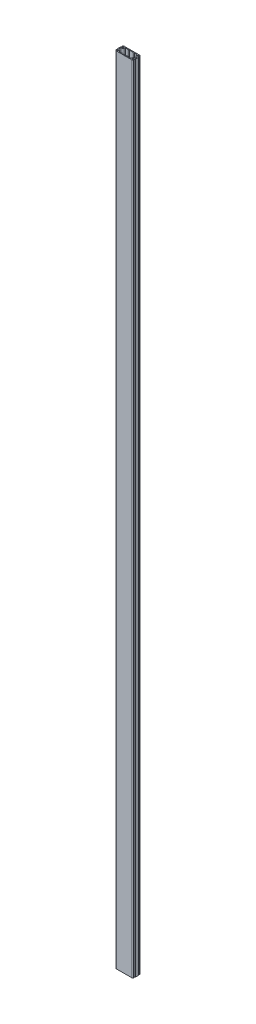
ISO-10303-21;
HEADER;
FILE_DESCRIPTION(('STEP AP214'),'2;1');
FILE_NAME('part.step','',(''),(''),'','','');
FILE_SCHEMA(('AUTOMOTIVE_DESIGN { 1 0 10303 214 1 1 1 1 }'));
ENDSEC;
DATA;
#1=APPLICATION_CONTEXT('core data for automotive mechanical design processes');
#2=APPLICATION_PROTOCOL_DEFINITION('international standard','automotive_design',2000,#1);
#3=PRODUCT_CONTEXT('',#1,'mechanical');
#4=PRODUCT('Part','Part','',(#3));
#5=PRODUCT_RELATED_PRODUCT_CATEGORY('part','',(#4));
#6=PRODUCT_DEFINITION_FORMATION('','',#4);
#7=PRODUCT_DEFINITION_CONTEXT('part definition',#1,'design');
#8=PRODUCT_DEFINITION('design','',#6,#7);
#9=PRODUCT_DEFINITION_SHAPE('','',#8);
#10=(LENGTH_UNIT() NAMED_UNIT(*) SI_UNIT(.MILLI.,.METRE.));
#11=(NAMED_UNIT(*) PLANE_ANGLE_UNIT() SI_UNIT($,.RADIAN.));
#12=(NAMED_UNIT(*) SI_UNIT($,.STERADIAN.) SOLID_ANGLE_UNIT());
#13=UNCERTAINTY_MEASURE_WITH_UNIT(LENGTH_MEASURE(1.E-05),#10,'distance_accuracy_value','');
#14=(GEOMETRIC_REPRESENTATION_CONTEXT(3) GLOBAL_UNCERTAINTY_ASSIGNED_CONTEXT((#13)) GLOBAL_UNIT_ASSIGNED_CONTEXT((#10,
#11,#12)) REPRESENTATION_CONTEXT('',''));
#15=CARTESIAN_POINT('',(0.,0.,0.));
#16=DIRECTION('',(0.,0.,1.));
#17=DIRECTION('',(1.,0.,0.));
#18=AXIS2_PLACEMENT_3D('',#15,#16,#17);
#19=CARTESIAN_POINT('',(84.6938611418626,7940.,-30.5717765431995));
#20=DIRECTION('',(0.,1.,0.));
#21=DIRECTION('',(0.,0.,1.));
#22=AXIS2_PLACEMENT_3D('',#19,#20,#21);
#23=PLANE('',#22);
#24=CARTESIAN_POINT('',(84.6938611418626,7940.,-30.5717765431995));
#25=DIRECTION('',(0.,1.,0.));
#26=DIRECTION('',(0.,0.,1.));
#27=AXIS2_PLACEMENT_3D('',#24,#25,#26);
#28=CIRCLE('',#27,3.99999999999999);
#29=CARTESIAN_POINT('',(81.1914378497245,7940.,-28.6396711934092));
#30=VERTEX_POINT('',#29);
#31=CARTESIAN_POINT('',(88.1962844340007,7940.,-32.5038818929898));
#32=VERTEX_POINT('',#31);
#33=EDGE_CURVE('E598',#30,#32,#28,.T.);
#34=ORIENTED_EDGE('',*,*,#33,.T.);
#35=CARTESIAN_POINT('',(75.5,7940.,-25.5));
#36=DIRECTION('',(0.,1.,0.));
#37=DIRECTION('',(0.,0.,1.));
#38=AXIS2_PLACEMENT_3D('',#35,#36,#37);
#39=CIRCLE('',#38,14.5);
#40=CARTESIAN_POINT('',(75.5,7940.,-40.));
#41=VERTEX_POINT('',#40);
#42=EDGE_CURVE('E601',#32,#41,#39,.T.);
#43=ORIENTED_EDGE('',*,*,#42,.T.);
#44=DIRECTION('',(-1.,0.,0.));
#45=VECTOR('',#44,1.);
#46=CARTESIAN_POINT('',(75.5,7940.,-40.));
#47=LINE('',#46,#45);
#48=CARTESIAN_POINT('',(-75.5,7940.,-40.));
#49=VERTEX_POINT('',#48);
#50=EDGE_CURVE('E604',#41,#49,#47,.T.);
#51=ORIENTED_EDGE('',*,*,#50,.T.);
#52=CARTESIAN_POINT('',(-75.5,7940.,-25.5));
#53=DIRECTION('',(0.,1.,0.));
#54=DIRECTION('',(0.,0.,-1.));
#55=AXIS2_PLACEMENT_3D('',#52,#53,#54);
#56=CIRCLE('',#55,14.5);
#57=CARTESIAN_POINT('',(-88.1962844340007,7940.,-32.5038818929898));
#58=VERTEX_POINT('',#57);
#59=EDGE_CURVE('E606',#49,#58,#56,.T.);
#60=ORIENTED_EDGE('',*,*,#59,.T.);
#61=CARTESIAN_POINT('',(-84.6938611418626,7940.,-30.5717765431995));
#62=DIRECTION('',(0.,1.,0.));
#63=DIRECTION('',(0.,0.,-1.));
#64=AXIS2_PLACEMENT_3D('',#61,#62,#63);
#65=CIRCLE('',#64,3.99999999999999);
#66=CARTESIAN_POINT('',(-81.1914378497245,7940.,-28.6396711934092));
#67=VERTEX_POINT('',#66);
#68=EDGE_CURVE('E608',#58,#67,#65,.T.);
#69=ORIENTED_EDGE('',*,*,#68,.T.);
#70=CARTESIAN_POINT('',(-75.5,7940.,-25.5));
#71=DIRECTION('',(0.,-1.,0.));
#72=DIRECTION('',(0.,0.,-1.));
#73=AXIS2_PLACEMENT_3D('',#70,#71,#72);
#74=CIRCLE('',#73,6.5);
#75=CARTESIAN_POINT('',(-79.7220192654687,7940.,-20.5578796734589));
#76=VERTEX_POINT('',#75);
#77=EDGE_CURVE('E610',#67,#76,#74,.T.);
#78=ORIENTED_EDGE('',*,*,#77,.T.);
#79=CARTESIAN_POINT('',(-83.7691890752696,7940.,-15.8204308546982));
#80=DIRECTION('',(0.,1.,0.));
#81=DIRECTION('',(0.,0.,-1.));
#82=AXIS2_PLACEMENT_3D('',#79,#80,#81);
#83=CIRCLE('',#82,6.23081092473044);
#84=CARTESIAN_POINT('',(-90.,7940.,-15.8204308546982));
#85=VERTEX_POINT('',#84);
#86=EDGE_CURVE('E612',#76,#85,#83,.T.);
#87=ORIENTED_EDGE('',*,*,#86,.T.);
#88=DIRECTION('',(0.,0.,1.));
#89=VECTOR('',#88,1.);
#90=CARTESIAN_POINT('',(-90.,7940.,15.8204308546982));
#91=LINE('',#90,#89);
#92=CARTESIAN_POINT('',(-90.,7940.,15.8204308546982));
#93=VERTEX_POINT('',#92);
#94=EDGE_CURVE('E614',#85,#93,#91,.T.);
#95=ORIENTED_EDGE('',*,*,#94,.T.);
#96=CARTESIAN_POINT('',(-83.7691890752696,7940.,15.8204308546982));
#97=DIRECTION('',(0.,1.,0.));
#98=DIRECTION('',(0.,0.,1.));
#99=AXIS2_PLACEMENT_3D('',#96,#97,#98);
#100=CIRCLE('',#99,6.23081092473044);
#101=CARTESIAN_POINT('',(-79.7220192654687,7940.,20.5578796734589));
#102=VERTEX_POINT('',#101);
#103=EDGE_CURVE('E616',#93,#102,#100,.T.);
#104=ORIENTED_EDGE('',*,*,#103,.T.);
#105=CARTESIAN_POINT('',(-75.5,7940.,25.5));
#106=DIRECTION('',(0.,-1.,0.));
#107=DIRECTION('',(0.,0.,1.));
#108=AXIS2_PLACEMENT_3D('',#105,#106,#107);
#109=CIRCLE('',#108,6.5);
#110=CARTESIAN_POINT('',(-81.1914378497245,7940.,28.6396711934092));
#111=VERTEX_POINT('',#110);
#112=EDGE_CURVE('E618',#102,#111,#109,.T.);
#113=ORIENTED_EDGE('',*,*,#112,.T.);
#114=CARTESIAN_POINT('',(-84.6938611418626,7940.,30.5717765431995));
#115=DIRECTION('',(0.,1.,0.));
#116=DIRECTION('',(0.,0.,1.));
#117=AXIS2_PLACEMENT_3D('',#114,#115,#116);
#118=CIRCLE('',#117,3.99999999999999);
#119=CARTESIAN_POINT('',(-88.1962844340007,7940.,32.5038818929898));
#120=VERTEX_POINT('',#119);
#121=EDGE_CURVE('E620',#111,#120,#118,.T.);
#122=ORIENTED_EDGE('',*,*,#121,.T.);
#123=CARTESIAN_POINT('',(-75.5,7940.,25.5));
#124=DIRECTION('',(0.,1.,0.));
#125=DIRECTION('',(0.,0.,1.));
#126=AXIS2_PLACEMENT_3D('',#123,#124,#125);
#127=CIRCLE('',#126,14.5);
#128=CARTESIAN_POINT('',(-75.5,7940.,40.));
#129=VERTEX_POINT('',#128);
#130=EDGE_CURVE('E622',#120,#129,#127,.T.);
#131=ORIENTED_EDGE('',*,*,#130,.T.);
#132=DIRECTION('',(1.,0.,0.));
#133=VECTOR('',#132,1.);
#134=CARTESIAN_POINT('',(75.5,7940.,40.));
#135=LINE('',#134,#133);
#136=CARTESIAN_POINT('',(75.5,7940.,40.));
#137=VERTEX_POINT('',#136);
#138=EDGE_CURVE('E624',#129,#137,#135,.T.);
#139=ORIENTED_EDGE('',*,*,#138,.T.);
#140=CARTESIAN_POINT('',(75.5,7940.,25.5));
#141=DIRECTION('',(0.,1.,0.));
#142=DIRECTION('',(0.,0.,-1.));
#143=AXIS2_PLACEMENT_3D('',#140,#141,#142);
#144=CIRCLE('',#143,14.5);
#145=CARTESIAN_POINT('',(88.1962844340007,7940.,32.5038818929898));
#146=VERTEX_POINT('',#145);
#147=EDGE_CURVE('E626',#137,#146,#144,.T.);
#148=ORIENTED_EDGE('',*,*,#147,.T.);
#149=CARTESIAN_POINT('',(84.6938611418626,7940.,30.5717765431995));
#150=DIRECTION('',(0.,1.,0.));
#151=DIRECTION('',(0.,0.,-1.));
#152=AXIS2_PLACEMENT_3D('',#149,#150,#151);
#153=CIRCLE('',#152,3.99999999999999);
#154=CARTESIAN_POINT('',(81.1914378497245,7940.,28.6396711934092));
#155=VERTEX_POINT('',#154);
#156=EDGE_CURVE('E628',#146,#155,#153,.T.);
#157=ORIENTED_EDGE('',*,*,#156,.T.);
#158=CARTESIAN_POINT('',(75.5,7940.,25.5));
#159=DIRECTION('',(0.,-1.,0.));
#160=DIRECTION('',(0.,0.,-1.));
#161=AXIS2_PLACEMENT_3D('',#158,#159,#160);
#162=CIRCLE('',#161,6.5);
#163=CARTESIAN_POINT('',(79.7220192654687,7940.,20.5578796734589));
#164=VERTEX_POINT('',#163);
#165=EDGE_CURVE('E630',#155,#164,#162,.T.);
#166=ORIENTED_EDGE('',*,*,#165,.T.);
#167=CARTESIAN_POINT('',(83.7691890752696,7940.,15.8204308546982));
#168=DIRECTION('',(0.,1.,0.));
#169=DIRECTION('',(0.,0.,-1.));
#170=AXIS2_PLACEMENT_3D('',#167,#168,#169);
#171=CIRCLE('',#170,6.23081092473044);
#172=CARTESIAN_POINT('',(90.,7940.,15.8204308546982));
#173=VERTEX_POINT('',#172);
#174=EDGE_CURVE('E632',#164,#173,#171,.T.);
#175=ORIENTED_EDGE('',*,*,#174,.T.);
#176=DIRECTION('',(0.,0.,-1.));
#177=VECTOR('',#176,1.);
#178=CARTESIAN_POINT('',(90.,7940.,15.8204308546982));
#179=LINE('',#178,#177);
#180=CARTESIAN_POINT('',(90.,7940.,-15.8204308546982));
#181=VERTEX_POINT('',#180);
#182=EDGE_CURVE('E634',#173,#181,#179,.T.);
#183=ORIENTED_EDGE('',*,*,#182,.T.);
#184=CARTESIAN_POINT('',(83.7691890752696,7940.,-15.8204308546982));
#185=DIRECTION('',(0.,1.,0.));
#186=DIRECTION('',(0.,0.,1.));
#187=AXIS2_PLACEMENT_3D('',#184,#185,#186);
#188=CIRCLE('',#187,6.23081092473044);
#189=CARTESIAN_POINT('',(79.7220192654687,7940.,-20.5578796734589));
#190=VERTEX_POINT('',#189);
#191=EDGE_CURVE('E636',#181,#190,#188,.T.);
#192=ORIENTED_EDGE('',*,*,#191,.T.);
#193=CARTESIAN_POINT('',(75.5,7940.,-25.5));
#194=DIRECTION('',(0.,-1.,0.));
#195=DIRECTION('',(0.,0.,1.));
#196=AXIS2_PLACEMENT_3D('',#193,#194,#195);
#197=CIRCLE('',#196,6.5);
#198=EDGE_CURVE('E638',#190,#30,#197,.T.);
#199=ORIENTED_EDGE('',*,*,#198,.T.);
#200=EDGE_LOOP('',(#34,#43,#51,#60,#69,#78,#87,#95,#104,#113,#122,#131,#139,#148,#157,#166,#175,
#183,#192,#199));
#201=FACE_BOUND('',#200,.T.);
#202=CARTESIAN_POINT('',(54.5,7940.,-25.5));
#203=DIRECTION('',(0.,1.,0.));
#204=DIRECTION('',(0.,0.,1.));
#205=AXIS2_PLACEMENT_3D('',#202,#203,#204);
#206=CIRCLE('',#205,6.5);
#207=CARTESIAN_POINT('',(61.,7940.,-25.5));
#208=VERTEX_POINT('',#207);
#209=CARTESIAN_POINT('',(54.5,7940.,-32.));
#210=VERTEX_POINT('',#209);
#211=EDGE_CURVE('E373',#208,#210,#206,.T.);
#212=ORIENTED_EDGE('',*,*,#211,.F.);
#213=CARTESIAN_POINT('',(75.5,7940.,-25.5));
#214=DIRECTION('',(0.,-1.,0.));
#215=DIRECTION('',(0.,0.,1.));
#216=AXIS2_PLACEMENT_3D('',#213,#214,#215);
#217=CIRCLE('',#216,14.5);
#218=CARTESIAN_POINT('',(75.5,7940.,-11.));
#219=VERTEX_POINT('',#218);
#220=EDGE_CURVE('E365',#219,#208,#217,.T.);
#221=ORIENTED_EDGE('',*,*,#220,.F.);
#222=CARTESIAN_POINT('',(75.5,7940.,-4.5));
#223=DIRECTION('',(0.,1.,0.));
#224=DIRECTION('',(0.,0.,1.));
#225=AXIS2_PLACEMENT_3D('',#222,#223,#224);
#226=CIRCLE('',#225,6.5);
#227=CARTESIAN_POINT('',(82.,7940.,-4.5));
#228=VERTEX_POINT('',#227);
#229=EDGE_CURVE('E446',#228,#219,#226,.T.);
#230=ORIENTED_EDGE('',*,*,#229,.F.);
#231=DIRECTION('',(0.,0.,-1.));
#232=VECTOR('',#231,1.);
#233=CARTESIAN_POINT('',(82.,7940.,-4.5));
#234=LINE('',#233,#232);
#235=CARTESIAN_POINT('',(82.,7940.,4.5));
#236=VERTEX_POINT('',#235);
#237=EDGE_CURVE('E444',#236,#228,#234,.T.);
#238=ORIENTED_EDGE('',*,*,#237,.F.);
#239=CARTESIAN_POINT('',(75.5,7940.,4.5));
#240=DIRECTION('',(0.,1.,0.));
#241=DIRECTION('',(0.,0.,-1.));
#242=AXIS2_PLACEMENT_3D('',#239,#240,#241);
#243=CIRCLE('',#242,6.5);
#244=CARTESIAN_POINT('',(75.5,7940.,11.));
#245=VERTEX_POINT('',#244);
#246=EDGE_CURVE('E442',#245,#236,#243,.T.);
#247=ORIENTED_EDGE('',*,*,#246,.F.);
#248=CARTESIAN_POINT('',(75.5,7940.,25.5));
#249=DIRECTION('',(0.,-1.,0.));
#250=DIRECTION('',(0.,0.,-1.));
#251=AXIS2_PLACEMENT_3D('',#248,#249,#250);
#252=CIRCLE('',#251,14.5);
#253=CARTESIAN_POINT('',(61.,7940.,25.5));
#254=VERTEX_POINT('',#253);
#255=EDGE_CURVE('E440',#254,#245,#252,.T.);
#256=ORIENTED_EDGE('',*,*,#255,.F.);
#257=CARTESIAN_POINT('',(54.5,7940.,25.5));
#258=DIRECTION('',(0.,1.,0.));
#259=DIRECTION('',(0.,0.,-1.));
#260=AXIS2_PLACEMENT_3D('',#257,#258,#259);
#261=CIRCLE('',#260,6.5);
#262=CARTESIAN_POINT('',(54.5,7940.,32.));
#263=VERTEX_POINT('',#262);
#264=EDGE_CURVE('E438',#263,#254,#261,.T.);
#265=ORIENTED_EDGE('',*,*,#264,.F.);
#266=DIRECTION('',(1.,0.,0.));
#267=VECTOR('',#266,1.);
#268=CARTESIAN_POINT('',(32.5172988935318,7940.,32.));
#269=LINE('',#268,#267);
#270=CARTESIAN_POINT('',(32.5172988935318,7940.,32.));
#271=VERTEX_POINT('',#270);
#272=EDGE_CURVE('E436',#271,#263,#269,.T.);
#273=ORIENTED_EDGE('',*,*,#272,.F.);
#274=DIRECTION('',(0.642787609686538,0.,0.766044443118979));
#275=VECTOR('',#274,1.);
#276=CARTESIAN_POINT('',(30.,7940.,29.));
#277=LINE('',#276,#275);
#278=CARTESIAN_POINT('',(30.,7940.,29.));
#279=VERTEX_POINT('',#278);
#280=EDGE_CURVE('E434',#279,#271,#277,.T.);
#281=ORIENTED_EDGE('',*,*,#280,.F.);
#282=DIRECTION('',(1.,0.,0.));
#283=VECTOR('',#282,1.);
#284=CARTESIAN_POINT('',(20.,7940.,29.));
#285=LINE('',#284,#283);
#286=CARTESIAN_POINT('',(20.,7940.,29.));
#287=VERTEX_POINT('',#286);
#288=EDGE_CURVE('E432',#287,#279,#285,.T.);
#289=ORIENTED_EDGE('',*,*,#288,.F.);
#290=DIRECTION('',(0.642787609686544,0.,-0.766044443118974));
#291=VECTOR('',#290,1.);
#292=CARTESIAN_POINT('',(20.,7940.,29.));
#293=LINE('',#292,#291);
#294=CARTESIAN_POINT('',(17.4827011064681,7940.,32.));
#295=VERTEX_POINT('',#294);
#296=EDGE_CURVE('E430',#295,#287,#293,.T.);
#297=ORIENTED_EDGE('',*,*,#296,.F.);
#298=DIRECTION('',(1.,0.,0.));
#299=VECTOR('',#298,1.);
#300=CARTESIAN_POINT('',(-17.4827011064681,7940.,32.));
#301=LINE('',#300,#299);
#302=CARTESIAN_POINT('',(-17.4827011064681,7940.,32.));
#303=VERTEX_POINT('',#302);
#304=EDGE_CURVE('E428',#303,#295,#301,.T.);
#305=ORIENTED_EDGE('',*,*,#304,.F.);
#306=DIRECTION('',(0.642787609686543,0.,0.766044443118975));
#307=VECTOR('',#306,1.);
#308=CARTESIAN_POINT('',(-20.,7940.,29.));
#309=LINE('',#308,#307);
#310=CARTESIAN_POINT('',(-20.,7940.,29.));
#311=VERTEX_POINT('',#310);
#312=EDGE_CURVE('E426',#311,#303,#309,.T.);
#313=ORIENTED_EDGE('',*,*,#312,.F.);
#314=DIRECTION('',(1.,0.,0.));
#315=VECTOR('',#314,1.);
#316=CARTESIAN_POINT('',(-20.,7940.,29.));
#317=LINE('',#316,#315);
#318=CARTESIAN_POINT('',(-30.,7940.,29.));
#319=VERTEX_POINT('',#318);
#320=EDGE_CURVE('E424',#319,#311,#317,.T.);
#321=ORIENTED_EDGE('',*,*,#320,.F.);
#322=DIRECTION('',(0.642787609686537,0.,-0.76604444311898));
#323=VECTOR('',#322,1.);
#324=CARTESIAN_POINT('',(-30.,7940.,29.));
#325=LINE('',#324,#323);
#326=CARTESIAN_POINT('',(-32.5172988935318,7940.,32.));
#327=VERTEX_POINT('',#326);
#328=EDGE_CURVE('E422',#327,#319,#325,.T.);
#329=ORIENTED_EDGE('',*,*,#328,.F.);
#330=DIRECTION('',(1.,0.,0.));
#331=VECTOR('',#330,1.);
#332=CARTESIAN_POINT('',(-32.5172988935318,7940.,32.));
#333=LINE('',#332,#331);
#334=CARTESIAN_POINT('',(-54.5,7940.,32.));
#335=VERTEX_POINT('',#334);
#336=EDGE_CURVE('E420',#335,#327,#333,.T.);
#337=ORIENTED_EDGE('',*,*,#336,.F.);
#338=CARTESIAN_POINT('',(-54.5,7940.,25.5));
#339=DIRECTION('',(0.,1.,0.));
#340=DIRECTION('',(0.,0.,1.));
#341=AXIS2_PLACEMENT_3D('',#338,#339,#340);
#342=CIRCLE('',#341,6.5);
#343=CARTESIAN_POINT('',(-61.,7940.,25.5));
#344=VERTEX_POINT('',#343);
#345=EDGE_CURVE('E418',#344,#335,#342,.T.);
#346=ORIENTED_EDGE('',*,*,#345,.F.);
#347=CARTESIAN_POINT('',(-75.5,7940.,25.5));
#348=DIRECTION('',(0.,-1.,0.));
#349=DIRECTION('',(0.,0.,1.));
#350=AXIS2_PLACEMENT_3D('',#347,#348,#349);
#351=CIRCLE('',#350,14.5);
#352=CARTESIAN_POINT('',(-75.5,7940.,11.));
#353=VERTEX_POINT('',#352);
#354=EDGE_CURVE('E416',#353,#344,#351,.T.);
#355=ORIENTED_EDGE('',*,*,#354,.F.);
#356=CARTESIAN_POINT('',(-75.5,7940.,4.5));
#357=DIRECTION('',(0.,1.,0.));
#358=DIRECTION('',(0.,0.,1.));
#359=AXIS2_PLACEMENT_3D('',#356,#357,#358);
#360=CIRCLE('',#359,6.5);
#361=CARTESIAN_POINT('',(-82.,7940.,4.5));
#362=VERTEX_POINT('',#361);
#363=EDGE_CURVE('E414',#362,#353,#360,.T.);
#364=ORIENTED_EDGE('',*,*,#363,.F.);
#365=DIRECTION('',(0.,0.,1.));
#366=VECTOR('',#365,1.);
#367=CARTESIAN_POINT('',(-82.,7940.,-4.5));
#368=LINE('',#367,#366);
#369=CARTESIAN_POINT('',(-82.,7940.,-4.5));
#370=VERTEX_POINT('',#369);
#371=EDGE_CURVE('E412',#370,#362,#368,.T.);
#372=ORIENTED_EDGE('',*,*,#371,.F.);
#373=CARTESIAN_POINT('',(-75.5,7940.,-4.5));
#374=DIRECTION('',(0.,1.,0.));
#375=DIRECTION('',(0.,0.,-1.));
#376=AXIS2_PLACEMENT_3D('',#373,#374,#375);
#377=CIRCLE('',#376,6.5);
#378=CARTESIAN_POINT('',(-75.5,7940.,-11.));
#379=VERTEX_POINT('',#378);
#380=EDGE_CURVE('E410',#379,#370,#377,.T.);
#381=ORIENTED_EDGE('',*,*,#380,.F.);
#382=CARTESIAN_POINT('',(-75.5,7940.,-25.5));
#383=DIRECTION('',(0.,-1.,0.));
#384=DIRECTION('',(0.,0.,-1.));
#385=AXIS2_PLACEMENT_3D('',#382,#383,#384);
#386=CIRCLE('',#385,14.5);
#387=CARTESIAN_POINT('',(-61.,7940.,-25.5));
#388=VERTEX_POINT('',#387);
#389=EDGE_CURVE('E408',#388,#379,#386,.T.);
#390=ORIENTED_EDGE('',*,*,#389,.F.);
#391=CARTESIAN_POINT('',(-54.5,7940.,-25.5));
#392=DIRECTION('',(0.,1.,0.));
#393=DIRECTION('',(0.,0.,-1.));
#394=AXIS2_PLACEMENT_3D('',#391,#392,#393);
#395=CIRCLE('',#394,6.5);
#396=CARTESIAN_POINT('',(-54.5,7940.,-32.));
#397=VERTEX_POINT('',#396);
#398=EDGE_CURVE('E406',#397,#388,#395,.T.);
#399=ORIENTED_EDGE('',*,*,#398,.F.);
#400=DIRECTION('',(-1.,0.,0.));
#401=VECTOR('',#400,1.);
#402=CARTESIAN_POINT('',(-32.5172988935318,7940.,-32.));
#403=LINE('',#402,#401);
#404=CARTESIAN_POINT('',(-32.5172988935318,7940.,-32.));
#405=VERTEX_POINT('',#404);
#406=EDGE_CURVE('E404',#405,#397,#403,.T.);
#407=ORIENTED_EDGE('',*,*,#406,.F.);
#408=DIRECTION('',(-0.642787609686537,0.,-0.76604444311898));
#409=VECTOR('',#408,1.);
#410=CARTESIAN_POINT('',(-30.,7940.,-29.));
#411=LINE('',#410,#409);
#412=CARTESIAN_POINT('',(-30.,7940.,-29.));
#413=VERTEX_POINT('',#412);
#414=EDGE_CURVE('E402',#413,#405,#411,.T.);
#415=ORIENTED_EDGE('',*,*,#414,.F.);
#416=DIRECTION('',(-1.,0.,0.));
#417=VECTOR('',#416,1.);
#418=CARTESIAN_POINT('',(-20.,7940.,-29.));
#419=LINE('',#418,#417);
#420=CARTESIAN_POINT('',(-20.,7940.,-29.));
#421=VERTEX_POINT('',#420);
#422=EDGE_CURVE('E400',#421,#413,#419,.T.);
#423=ORIENTED_EDGE('',*,*,#422,.F.);
#424=DIRECTION('',(-0.642787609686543,0.,0.766044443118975));
#425=VECTOR('',#424,1.);
#426=CARTESIAN_POINT('',(-20.,7940.,-29.));
#427=LINE('',#426,#425);
#428=CARTESIAN_POINT('',(-17.4827011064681,7940.,-32.));
#429=VERTEX_POINT('',#428);
#430=EDGE_CURVE('E398',#429,#421,#427,.T.);
#431=ORIENTED_EDGE('',*,*,#430,.F.);
#432=DIRECTION('',(-1.,0.,0.));
#433=VECTOR('',#432,1.);
#434=CARTESIAN_POINT('',(-17.4827011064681,7940.,-32.));
#435=LINE('',#434,#433);
#436=CARTESIAN_POINT('',(17.4827011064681,7940.,-32.));
#437=VERTEX_POINT('',#436);
#438=EDGE_CURVE('E396',#437,#429,#435,.T.);
#439=ORIENTED_EDGE('',*,*,#438,.F.);
#440=DIRECTION('',(-0.642787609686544,0.,-0.766044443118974));
#441=VECTOR('',#440,1.);
#442=CARTESIAN_POINT('',(20.,7940.,-29.));
#443=LINE('',#442,#441);
#444=CARTESIAN_POINT('',(20.,7940.,-29.));
#445=VERTEX_POINT('',#444);
#446=EDGE_CURVE('E394',#445,#437,#443,.T.);
#447=ORIENTED_EDGE('',*,*,#446,.F.);
#448=DIRECTION('',(-1.,0.,0.));
#449=VECTOR('',#448,1.);
#450=CARTESIAN_POINT('',(20.,7940.,-29.));
#451=LINE('',#450,#449);
#452=CARTESIAN_POINT('',(30.,7940.,-29.));
#453=VERTEX_POINT('',#452);
#454=EDGE_CURVE('E392',#453,#445,#451,.T.);
#455=ORIENTED_EDGE('',*,*,#454,.F.);
#456=DIRECTION('',(-0.642787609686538,0.,0.766044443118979));
#457=VECTOR('',#456,1.);
#458=CARTESIAN_POINT('',(30.,7940.,-29.));
#459=LINE('',#458,#457);
#460=CARTESIAN_POINT('',(32.5172988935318,7940.,-32.));
#461=VERTEX_POINT('',#460);
#462=EDGE_CURVE('E388',#461,#453,#459,.T.);
#463=ORIENTED_EDGE('',*,*,#462,.F.);
#464=DIRECTION('',(-1.,0.,0.));
#465=VECTOR('',#464,1.);
#466=CARTESIAN_POINT('',(32.5172988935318,7940.,-32.));
#467=LINE('',#466,#465);
#468=EDGE_CURVE('E386',#210,#461,#467,.T.);
#469=ORIENTED_EDGE('',*,*,#468,.F.);
#470=EDGE_LOOP('',(#212,#221,#230,#238,#247,#256,#265,#273,#281,#289,#297,#305,#313,#321,#329,
#337,#346,#355,#364,#372,#381,#390,#399,#407,#415,#423,#431,#439,#447,#455,#463,#469));
#471=FACE_BOUND('',#470,.T.);
#472=ADVANCED_FACE('F36',(#201,#471),#23,.T.);
#473=CARTESIAN_POINT('',(84.6938611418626,0.,-30.5717765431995));
#474=DIRECTION('',(0.,1.,0.));
#475=DIRECTION('',(0.,0.,1.));
#476=AXIS2_PLACEMENT_3D('',#473,#474,#475);
#477=PLANE('',#476);
#478=CARTESIAN_POINT('',(84.6938611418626,0.,-30.5717765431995));
#479=DIRECTION('',(0.,1.,0.));
#480=DIRECTION('',(0.,0.,1.));
#481=AXIS2_PLACEMENT_3D('',#478,#479,#480);
#482=CIRCLE('',#481,3.99999999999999);
#483=CARTESIAN_POINT('',(81.1914378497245,0.,-28.6396711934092));
#484=VERTEX_POINT('',#483);
#485=CARTESIAN_POINT('',(88.1962844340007,0.,-32.5038818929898));
#486=VERTEX_POINT('',#485);
#487=EDGE_CURVE('E381',#484,#486,#482,.T.);
#488=ORIENTED_EDGE('',*,*,#487,.F.);
#489=CARTESIAN_POINT('',(75.5,0.,-25.5));
#490=DIRECTION('',(0.,-1.,0.));
#491=DIRECTION('',(0.,0.,1.));
#492=AXIS2_PLACEMENT_3D('',#489,#490,#491);
#493=CIRCLE('',#492,6.5);
#494=CARTESIAN_POINT('',(79.7220192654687,0.,-20.5578796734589));
#495=VERTEX_POINT('',#494);
#496=EDGE_CURVE('E602',#495,#484,#493,.T.);
#497=ORIENTED_EDGE('',*,*,#496,.F.);
#498=CARTESIAN_POINT('',(83.7691890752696,0.,-15.8204308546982));
#499=DIRECTION('',(0.,1.,0.));
#500=DIRECTION('',(0.,0.,1.));
#501=AXIS2_PLACEMENT_3D('',#498,#499,#500);
#502=CIRCLE('',#501,6.23081092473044);
#503=CARTESIAN_POINT('',(90.,0.,-15.8204308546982));
#504=VERTEX_POINT('',#503);
#505=EDGE_CURVE('E677',#504,#495,#502,.T.);
#506=ORIENTED_EDGE('',*,*,#505,.F.);
#507=DIRECTION('',(0.,0.,-1.));
#508=VECTOR('',#507,1.);
#509=CARTESIAN_POINT('',(90.,0.,15.8204308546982));
#510=LINE('',#509,#508);
#511=CARTESIAN_POINT('',(90.,0.,15.8204308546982));
#512=VERTEX_POINT('',#511);
#513=EDGE_CURVE('E675',#512,#504,#510,.T.);
#514=ORIENTED_EDGE('',*,*,#513,.F.);
#515=CARTESIAN_POINT('',(83.7691890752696,0.,15.8204308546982));
#516=DIRECTION('',(0.,1.,0.));
#517=DIRECTION('',(0.,0.,-1.));
#518=AXIS2_PLACEMENT_3D('',#515,#516,#517);
#519=CIRCLE('',#518,6.23081092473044);
#520=CARTESIAN_POINT('',(79.7220192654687,0.,20.5578796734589));
#521=VERTEX_POINT('',#520);
#522=EDGE_CURVE('E673',#521,#512,#519,.T.);
#523=ORIENTED_EDGE('',*,*,#522,.F.);
#524=CARTESIAN_POINT('',(75.5,0.,25.5));
#525=DIRECTION('',(0.,-1.,0.));
#526=DIRECTION('',(0.,0.,-1.));
#527=AXIS2_PLACEMENT_3D('',#524,#525,#526);
#528=CIRCLE('',#527,6.5);
#529=CARTESIAN_POINT('',(81.1914378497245,0.,28.6396711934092));
#530=VERTEX_POINT('',#529);
#531=EDGE_CURVE('E671',#530,#521,#528,.T.);
#532=ORIENTED_EDGE('',*,*,#531,.F.);
#533=CARTESIAN_POINT('',(84.6938611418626,0.,30.5717765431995));
#534=DIRECTION('',(0.,1.,0.));
#535=DIRECTION('',(0.,0.,-1.));
#536=AXIS2_PLACEMENT_3D('',#533,#534,#535);
#537=CIRCLE('',#536,3.99999999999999);
#538=CARTESIAN_POINT('',(88.1962844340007,0.,32.5038818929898));
#539=VERTEX_POINT('',#538);
#540=EDGE_CURVE('E669',#539,#530,#537,.T.);
#541=ORIENTED_EDGE('',*,*,#540,.F.);
#542=CARTESIAN_POINT('',(75.5,0.,25.5));
#543=DIRECTION('',(0.,1.,0.));
#544=DIRECTION('',(0.,0.,-1.));
#545=AXIS2_PLACEMENT_3D('',#542,#543,#544);
#546=CIRCLE('',#545,14.5);
#547=CARTESIAN_POINT('',(75.5,0.,40.));
#548=VERTEX_POINT('',#547);
#549=EDGE_CURVE('E667',#548,#539,#546,.T.);
#550=ORIENTED_EDGE('',*,*,#549,.F.);
#551=DIRECTION('',(1.,0.,0.));
#552=VECTOR('',#551,1.);
#553=CARTESIAN_POINT('',(75.5,0.,40.));
#554=LINE('',#553,#552);
#555=CARTESIAN_POINT('',(-75.5,0.,40.));
#556=VERTEX_POINT('',#555);
#557=EDGE_CURVE('E665',#556,#548,#554,.T.);
#558=ORIENTED_EDGE('',*,*,#557,.F.);
#559=CARTESIAN_POINT('',(-75.5,0.,25.5));
#560=DIRECTION('',(0.,1.,0.));
#561=DIRECTION('',(0.,0.,1.));
#562=AXIS2_PLACEMENT_3D('',#559,#560,#561);
#563=CIRCLE('',#562,14.5);
#564=CARTESIAN_POINT('',(-88.1962844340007,0.,32.5038818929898));
#565=VERTEX_POINT('',#564);
#566=EDGE_CURVE('E663',#565,#556,#563,.T.);
#567=ORIENTED_EDGE('',*,*,#566,.F.);
#568=CARTESIAN_POINT('',(-84.6938611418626,0.,30.5717765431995));
#569=DIRECTION('',(0.,1.,0.));
#570=DIRECTION('',(0.,0.,1.));
#571=AXIS2_PLACEMENT_3D('',#568,#569,#570);
#572=CIRCLE('',#571,3.99999999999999);
#573=CARTESIAN_POINT('',(-81.1914378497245,0.,28.6396711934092));
#574=VERTEX_POINT('',#573);
#575=EDGE_CURVE('E661',#574,#565,#572,.T.);
#576=ORIENTED_EDGE('',*,*,#575,.F.);
#577=CARTESIAN_POINT('',(-75.5,0.,25.5));
#578=DIRECTION('',(0.,-1.,0.));
#579=DIRECTION('',(0.,0.,1.));
#580=AXIS2_PLACEMENT_3D('',#577,#578,#579);
#581=CIRCLE('',#580,6.5);
#582=CARTESIAN_POINT('',(-79.7220192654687,0.,20.5578796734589));
#583=VERTEX_POINT('',#582);
#584=EDGE_CURVE('E659',#583,#574,#581,.T.);
#585=ORIENTED_EDGE('',*,*,#584,.F.);
#586=CARTESIAN_POINT('',(-83.7691890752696,0.,15.8204308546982));
#587=DIRECTION('',(0.,1.,0.));
#588=DIRECTION('',(0.,0.,1.));
#589=AXIS2_PLACEMENT_3D('',#586,#587,#588);
#590=CIRCLE('',#589,6.23081092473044);
#591=CARTESIAN_POINT('',(-90.,0.,15.8204308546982));
#592=VERTEX_POINT('',#591);
#593=EDGE_CURVE('E657',#592,#583,#590,.T.);
#594=ORIENTED_EDGE('',*,*,#593,.F.);
#595=DIRECTION('',(0.,0.,1.));
#596=VECTOR('',#595,1.);
#597=CARTESIAN_POINT('',(-90.,0.,15.8204308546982));
#598=LINE('',#597,#596);
#599=CARTESIAN_POINT('',(-90.,0.,-15.8204308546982));
#600=VERTEX_POINT('',#599);
#601=EDGE_CURVE('E655',#600,#592,#598,.T.);
#602=ORIENTED_EDGE('',*,*,#601,.F.);
#603=CARTESIAN_POINT('',(-83.7691890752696,0.,-15.8204308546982));
#604=DIRECTION('',(0.,1.,0.));
#605=DIRECTION('',(0.,0.,-1.));
#606=AXIS2_PLACEMENT_3D('',#603,#604,#605);
#607=CIRCLE('',#606,6.23081092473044);
#608=CARTESIAN_POINT('',(-79.7220192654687,0.,-20.5578796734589));
#609=VERTEX_POINT('',#608);
#610=EDGE_CURVE('E653',#609,#600,#607,.T.);
#611=ORIENTED_EDGE('',*,*,#610,.F.);
#612=CARTESIAN_POINT('',(-75.5,0.,-25.5));
#613=DIRECTION('',(0.,-1.,0.));
#614=DIRECTION('',(0.,0.,-1.));
#615=AXIS2_PLACEMENT_3D('',#612,#613,#614);
#616=CIRCLE('',#615,6.5);
#617=CARTESIAN_POINT('',(-81.1914378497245,0.,-28.6396711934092));
#618=VERTEX_POINT('',#617);
#619=EDGE_CURVE('E651',#618,#609,#616,.T.);
#620=ORIENTED_EDGE('',*,*,#619,.F.);
#621=CARTESIAN_POINT('',(-84.6938611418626,0.,-30.5717765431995));
#622=DIRECTION('',(0.,1.,0.));
#623=DIRECTION('',(0.,0.,-1.));
#624=AXIS2_PLACEMENT_3D('',#621,#622,#623);
#625=CIRCLE('',#624,3.99999999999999);
#626=CARTESIAN_POINT('',(-88.1962844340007,0.,-32.5038818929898));
#627=VERTEX_POINT('',#626);
#628=EDGE_CURVE('E649',#627,#618,#625,.T.);
#629=ORIENTED_EDGE('',*,*,#628,.F.);
#630=CARTESIAN_POINT('',(-75.5,0.,-25.5));
#631=DIRECTION('',(0.,1.,0.));
#632=DIRECTION('',(0.,0.,-1.));
#633=AXIS2_PLACEMENT_3D('',#630,#631,#632);
#634=CIRCLE('',#633,14.5);
#635=CARTESIAN_POINT('',(-75.5,0.,-40.));
#636=VERTEX_POINT('',#635);
#637=EDGE_CURVE('E647',#636,#627,#634,.T.);
#638=ORIENTED_EDGE('',*,*,#637,.F.);
#639=DIRECTION('',(-1.,0.,0.));
#640=VECTOR('',#639,1.);
#641=CARTESIAN_POINT('',(75.5,0.,-40.));
#642=LINE('',#641,#640);
#643=CARTESIAN_POINT('',(75.5,0.,-40.));
#644=VERTEX_POINT('',#643);
#645=EDGE_CURVE('E645',#644,#636,#642,.T.);
#646=ORIENTED_EDGE('',*,*,#645,.F.);
#647=CARTESIAN_POINT('',(75.5,0.,-25.5));
#648=DIRECTION('',(0.,1.,0.));
#649=DIRECTION('',(0.,0.,1.));
#650=AXIS2_PLACEMENT_3D('',#647,#648,#649);
#651=CIRCLE('',#650,14.5);
#652=EDGE_CURVE('E643',#486,#644,#651,.T.);
#653=ORIENTED_EDGE('',*,*,#652,.F.);
#654=EDGE_LOOP('',(#488,#497,#506,#514,#523,#532,#541,#550,#558,#567,#576,#585,#594,#602,#611,
#620,#629,#638,#646,#653));
#655=FACE_BOUND('',#654,.T.);
#656=CARTESIAN_POINT('',(75.5,0.,-25.5));
#657=DIRECTION('',(0.,-1.,0.));
#658=DIRECTION('',(0.,0.,1.));
#659=AXIS2_PLACEMENT_3D('',#656,#657,#658);
#660=CIRCLE('',#659,14.5);
#661=CARTESIAN_POINT('',(75.5,0.,-11.));
#662=VERTEX_POINT('',#661);
#663=CARTESIAN_POINT('',(61.,0.,-25.5));
#664=VERTEX_POINT('',#663);
#665=EDGE_CURVE('E59',#662,#664,#660,.T.);
#666=ORIENTED_EDGE('',*,*,#665,.T.);
#667=CARTESIAN_POINT('',(54.5,0.,-25.5));
#668=DIRECTION('',(0.,1.,0.));
#669=DIRECTION('',(0.,0.,1.));
#670=AXIS2_PLACEMENT_3D('',#667,#668,#669);
#671=CIRCLE('',#670,6.5);
#672=CARTESIAN_POINT('',(54.5,0.,-32.));
#673=VERTEX_POINT('',#672);
#674=EDGE_CURVE('E380',#664,#673,#671,.T.);
#675=ORIENTED_EDGE('',*,*,#674,.T.);
#676=DIRECTION('',(-1.,0.,0.));
#677=VECTOR('',#676,1.);
#678=CARTESIAN_POINT('',(32.5172988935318,0.,-32.));
#679=LINE('',#678,#677);
#680=CARTESIAN_POINT('',(32.5172988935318,0.,-32.));
#681=VERTEX_POINT('',#680);
#682=EDGE_CURVE('E450',#673,#681,#679,.T.);
#683=ORIENTED_EDGE('',*,*,#682,.T.);
#684=DIRECTION('',(-0.642787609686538,0.,0.766044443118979));
#685=VECTOR('',#684,1.);
#686=CARTESIAN_POINT('',(30.,0.,-29.));
#687=LINE('',#686,#685);
#688=CARTESIAN_POINT('',(30.,0.,-29.));
#689=VERTEX_POINT('',#688);
#690=EDGE_CURVE('E453',#681,#689,#687,.T.);
#691=ORIENTED_EDGE('',*,*,#690,.T.);
#692=DIRECTION('',(-1.,0.,0.));
#693=VECTOR('',#692,1.);
#694=CARTESIAN_POINT('',(20.,0.,-29.));
#695=LINE('',#694,#693);
#696=CARTESIAN_POINT('',(20.,0.,-29.));
#697=VERTEX_POINT('',#696);
#698=EDGE_CURVE('E456',#689,#697,#695,.T.);
#699=ORIENTED_EDGE('',*,*,#698,.T.);
#700=DIRECTION('',(-0.642787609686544,0.,-0.766044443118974));
#701=VECTOR('',#700,1.);
#702=CARTESIAN_POINT('',(20.,0.,-29.));
#703=LINE('',#702,#701);
#704=CARTESIAN_POINT('',(17.4827011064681,0.,-32.));
#705=VERTEX_POINT('',#704);
#706=EDGE_CURVE('E459',#697,#705,#703,.T.);
#707=ORIENTED_EDGE('',*,*,#706,.T.);
#708=DIRECTION('',(-1.,0.,0.));
#709=VECTOR('',#708,1.);
#710=CARTESIAN_POINT('',(-17.4827011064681,0.,-32.));
#711=LINE('',#710,#709);
#712=CARTESIAN_POINT('',(-17.4827011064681,0.,-32.));
#713=VERTEX_POINT('',#712);
#714=EDGE_CURVE('E462',#705,#713,#711,.T.);
#715=ORIENTED_EDGE('',*,*,#714,.T.);
#716=DIRECTION('',(-0.642787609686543,0.,0.766044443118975));
#717=VECTOR('',#716,1.);
#718=CARTESIAN_POINT('',(-20.,0.,-29.));
#719=LINE('',#718,#717);
#720=CARTESIAN_POINT('',(-20.,0.,-29.));
#721=VERTEX_POINT('',#720);
#722=EDGE_CURVE('E465',#713,#721,#719,.T.);
#723=ORIENTED_EDGE('',*,*,#722,.T.);
#724=DIRECTION('',(-1.,0.,0.));
#725=VECTOR('',#724,1.);
#726=CARTESIAN_POINT('',(-20.,0.,-29.));
#727=LINE('',#726,#725);
#728=CARTESIAN_POINT('',(-30.,0.,-29.));
#729=VERTEX_POINT('',#728);
#730=EDGE_CURVE('E468',#721,#729,#727,.T.);
#731=ORIENTED_EDGE('',*,*,#730,.T.);
#732=DIRECTION('',(-0.642787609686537,0.,-0.76604444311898));
#733=VECTOR('',#732,1.);
#734=CARTESIAN_POINT('',(-30.,0.,-29.));
#735=LINE('',#734,#733);
#736=CARTESIAN_POINT('',(-32.5172988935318,0.,-32.));
#737=VERTEX_POINT('',#736);
#738=EDGE_CURVE('E471',#729,#737,#735,.T.);
#739=ORIENTED_EDGE('',*,*,#738,.T.);
#740=DIRECTION('',(-1.,0.,0.));
#741=VECTOR('',#740,1.);
#742=CARTESIAN_POINT('',(-32.5172988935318,0.,-32.));
#743=LINE('',#742,#741);
#744=CARTESIAN_POINT('',(-54.5,0.,-32.));
#745=VERTEX_POINT('',#744);
#746=EDGE_CURVE('E474',#737,#745,#743,.T.);
#747=ORIENTED_EDGE('',*,*,#746,.T.);
#748=CARTESIAN_POINT('',(-54.5,0.,-25.5));
#749=DIRECTION('',(0.,1.,0.));
#750=DIRECTION('',(0.,0.,-1.));
#751=AXIS2_PLACEMENT_3D('',#748,#749,#750);
#752=CIRCLE('',#751,6.5);
#753=CARTESIAN_POINT('',(-61.,0.,-25.5));
#754=VERTEX_POINT('',#753);
#755=EDGE_CURVE('E477',#745,#754,#752,.T.);
#756=ORIENTED_EDGE('',*,*,#755,.T.);
#757=CARTESIAN_POINT('',(-75.5,0.,-25.5));
#758=DIRECTION('',(0.,-1.,0.));
#759=DIRECTION('',(0.,0.,-1.));
#760=AXIS2_PLACEMENT_3D('',#757,#758,#759);
#761=CIRCLE('',#760,14.5);
#762=CARTESIAN_POINT('',(-75.5,0.,-11.));
#763=VERTEX_POINT('',#762);
#764=EDGE_CURVE('E480',#754,#763,#761,.T.);
#765=ORIENTED_EDGE('',*,*,#764,.T.);
#766=CARTESIAN_POINT('',(-75.5,0.,-4.5));
#767=DIRECTION('',(0.,1.,0.));
#768=DIRECTION('',(0.,0.,-1.));
#769=AXIS2_PLACEMENT_3D('',#766,#767,#768);
#770=CIRCLE('',#769,6.5);
#771=CARTESIAN_POINT('',(-82.,0.,-4.5));
#772=VERTEX_POINT('',#771);
#773=EDGE_CURVE('E483',#763,#772,#770,.T.);
#774=ORIENTED_EDGE('',*,*,#773,.T.);
#775=DIRECTION('',(0.,0.,1.));
#776=VECTOR('',#775,1.);
#777=CARTESIAN_POINT('',(-82.,0.,-4.5));
#778=LINE('',#777,#776);
#779=CARTESIAN_POINT('',(-82.,0.,4.5));
#780=VERTEX_POINT('',#779);
#781=EDGE_CURVE('E486',#772,#780,#778,.T.);
#782=ORIENTED_EDGE('',*,*,#781,.T.);
#783=CARTESIAN_POINT('',(-75.5,0.,4.5));
#784=DIRECTION('',(0.,1.,0.));
#785=DIRECTION('',(0.,0.,1.));
#786=AXIS2_PLACEMENT_3D('',#783,#784,#785);
#787=CIRCLE('',#786,6.5);
#788=CARTESIAN_POINT('',(-75.5,0.,11.));
#789=VERTEX_POINT('',#788);
#790=EDGE_CURVE('E489',#780,#789,#787,.T.);
#791=ORIENTED_EDGE('',*,*,#790,.T.);
#792=CARTESIAN_POINT('',(-75.5,0.,25.5));
#793=DIRECTION('',(0.,-1.,0.));
#794=DIRECTION('',(0.,0.,1.));
#795=AXIS2_PLACEMENT_3D('',#792,#793,#794);
#796=CIRCLE('',#795,14.5);
#797=CARTESIAN_POINT('',(-61.,0.,25.5));
#798=VERTEX_POINT('',#797);
#799=EDGE_CURVE('E492',#789,#798,#796,.T.);
#800=ORIENTED_EDGE('',*,*,#799,.T.);
#801=CARTESIAN_POINT('',(-54.5,0.,25.5));
#802=DIRECTION('',(0.,1.,0.));
#803=DIRECTION('',(0.,0.,1.));
#804=AXIS2_PLACEMENT_3D('',#801,#802,#803);
#805=CIRCLE('',#804,6.5);
#806=CARTESIAN_POINT('',(-54.5,0.,32.));
#807=VERTEX_POINT('',#806);
#808=EDGE_CURVE('E495',#798,#807,#805,.T.);
#809=ORIENTED_EDGE('',*,*,#808,.T.);
#810=DIRECTION('',(1.,0.,0.));
#811=VECTOR('',#810,1.);
#812=CARTESIAN_POINT('',(-32.5172988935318,0.,32.));
#813=LINE('',#812,#811);
#814=CARTESIAN_POINT('',(-32.5172988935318,0.,32.));
#815=VERTEX_POINT('',#814);
#816=EDGE_CURVE('E498',#807,#815,#813,.T.);
#817=ORIENTED_EDGE('',*,*,#816,.T.);
#818=DIRECTION('',(0.642787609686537,0.,-0.76604444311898));
#819=VECTOR('',#818,1.);
#820=CARTESIAN_POINT('',(-30.,0.,29.));
#821=LINE('',#820,#819);
#822=CARTESIAN_POINT('',(-30.,0.,29.));
#823=VERTEX_POINT('',#822);
#824=EDGE_CURVE('E501',#815,#823,#821,.T.);
#825=ORIENTED_EDGE('',*,*,#824,.T.);
#826=DIRECTION('',(1.,0.,0.));
#827=VECTOR('',#826,1.);
#828=CARTESIAN_POINT('',(-20.,0.,29.));
#829=LINE('',#828,#827);
#830=CARTESIAN_POINT('',(-20.,0.,29.));
#831=VERTEX_POINT('',#830);
#832=EDGE_CURVE('E504',#823,#831,#829,.T.);
#833=ORIENTED_EDGE('',*,*,#832,.T.);
#834=DIRECTION('',(0.642787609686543,0.,0.766044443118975));
#835=VECTOR('',#834,1.);
#836=CARTESIAN_POINT('',(-20.,0.,29.));
#837=LINE('',#836,#835);
#838=CARTESIAN_POINT('',(-17.4827011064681,0.,32.));
#839=VERTEX_POINT('',#838);
#840=EDGE_CURVE('E507',#831,#839,#837,.T.);
#841=ORIENTED_EDGE('',*,*,#840,.T.);
#842=DIRECTION('',(1.,0.,0.));
#843=VECTOR('',#842,1.);
#844=CARTESIAN_POINT('',(-17.4827011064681,0.,32.));
#845=LINE('',#844,#843);
#846=CARTESIAN_POINT('',(17.4827011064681,0.,32.));
#847=VERTEX_POINT('',#846);
#848=EDGE_CURVE('E510',#839,#847,#845,.T.);
#849=ORIENTED_EDGE('',*,*,#848,.T.);
#850=DIRECTION('',(0.642787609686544,0.,-0.766044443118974));
#851=VECTOR('',#850,1.);
#852=CARTESIAN_POINT('',(20.,0.,29.));
#853=LINE('',#852,#851);
#854=CARTESIAN_POINT('',(20.,0.,29.));
#855=VERTEX_POINT('',#854);
#856=EDGE_CURVE('E513',#847,#855,#853,.T.);
#857=ORIENTED_EDGE('',*,*,#856,.T.);
#858=DIRECTION('',(1.,0.,0.));
#859=VECTOR('',#858,1.);
#860=CARTESIAN_POINT('',(20.,0.,29.));
#861=LINE('',#860,#859);
#862=CARTESIAN_POINT('',(30.,0.,29.));
#863=VERTEX_POINT('',#862);
#864=EDGE_CURVE('E516',#855,#863,#861,.T.);
#865=ORIENTED_EDGE('',*,*,#864,.T.);
#866=DIRECTION('',(0.642787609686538,0.,0.766044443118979));
#867=VECTOR('',#866,1.);
#868=CARTESIAN_POINT('',(30.,0.,29.));
#869=LINE('',#868,#867);
#870=CARTESIAN_POINT('',(32.5172988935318,0.,32.));
#871=VERTEX_POINT('',#870);
#872=EDGE_CURVE('E519',#863,#871,#869,.T.);
#873=ORIENTED_EDGE('',*,*,#872,.T.);
#874=DIRECTION('',(1.,0.,0.));
#875=VECTOR('',#874,1.);
#876=CARTESIAN_POINT('',(32.5172988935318,0.,32.));
#877=LINE('',#876,#875);
#878=CARTESIAN_POINT('',(54.5,0.,32.));
#879=VERTEX_POINT('',#878);
#880=EDGE_CURVE('E522',#871,#879,#877,.T.);
#881=ORIENTED_EDGE('',*,*,#880,.T.);
#882=CARTESIAN_POINT('',(54.5,0.,25.5));
#883=DIRECTION('',(0.,1.,0.));
#884=DIRECTION('',(0.,0.,-1.));
#885=AXIS2_PLACEMENT_3D('',#882,#883,#884);
#886=CIRCLE('',#885,6.5);
#887=CARTESIAN_POINT('',(61.,0.,25.5));
#888=VERTEX_POINT('',#887);
#889=EDGE_CURVE('E525',#879,#888,#886,.T.);
#890=ORIENTED_EDGE('',*,*,#889,.T.);
#891=CARTESIAN_POINT('',(75.5,0.,25.5));
#892=DIRECTION('',(0.,-1.,0.));
#893=DIRECTION('',(0.,0.,-1.));
#894=AXIS2_PLACEMENT_3D('',#891,#892,#893);
#895=CIRCLE('',#894,14.5);
#896=CARTESIAN_POINT('',(75.5,0.,11.));
#897=VERTEX_POINT('',#896);
#898=EDGE_CURVE('E528',#888,#897,#895,.T.);
#899=ORIENTED_EDGE('',*,*,#898,.T.);
#900=CARTESIAN_POINT('',(75.5,0.,4.5));
#901=DIRECTION('',(0.,1.,0.));
#902=DIRECTION('',(0.,0.,-1.));
#903=AXIS2_PLACEMENT_3D('',#900,#901,#902);
#904=CIRCLE('',#903,6.5);
#905=CARTESIAN_POINT('',(82.,0.,4.5));
#906=VERTEX_POINT('',#905);
#907=EDGE_CURVE('E531',#897,#906,#904,.T.);
#908=ORIENTED_EDGE('',*,*,#907,.T.);
#909=DIRECTION('',(0.,0.,-1.));
#910=VECTOR('',#909,1.);
#911=CARTESIAN_POINT('',(82.,0.,-4.5));
#912=LINE('',#911,#910);
#913=CARTESIAN_POINT('',(82.,0.,-4.5));
#914=VERTEX_POINT('',#913);
#915=EDGE_CURVE('E534',#906,#914,#912,.T.);
#916=ORIENTED_EDGE('',*,*,#915,.T.);
#917=CARTESIAN_POINT('',(75.5,0.,-4.5));
#918=DIRECTION('',(0.,1.,0.));
#919=DIRECTION('',(0.,0.,1.));
#920=AXIS2_PLACEMENT_3D('',#917,#918,#919);
#921=CIRCLE('',#920,6.5);
#922=EDGE_CURVE('E374',#914,#662,#921,.T.);
#923=ORIENTED_EDGE('',*,*,#922,.T.);
#924=EDGE_LOOP('',(#666,#675,#683,#691,#699,#707,#715,#723,#731,#739,#747,#756,#765,#774,#782,
#791,#800,#809,#817,#825,#833,#841,#849,#857,#865,#873,#881,#890,#899,#908,#916,#923));
#925=FACE_BOUND('',#924,.T.);
#926=ADVANCED_FACE('F743',(#655,#925),#477,.F.);
#927=CARTESIAN_POINT('',(84.6938611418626,7940.,-30.5717765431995));
#928=DIRECTION('',(0.,-1.,0.));
#929=DIRECTION('',(0.,0.,-1.));
#930=AXIS2_PLACEMENT_3D('',#927,#928,#929);
#931=CYLINDRICAL_SURFACE('',#930,3.99999999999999);
#932=ORIENTED_EDGE('',*,*,#487,.T.);
#933=DIRECTION('',(0.,-1.,0.));
#934=VECTOR('',#933,1.);
#935=CARTESIAN_POINT('',(88.1962844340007,7940.,-32.5038818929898));
#936=LINE('',#935,#934);
#937=EDGE_CURVE('E11',#32,#486,#936,.T.);
#938=ORIENTED_EDGE('',*,*,#937,.F.);
#939=ORIENTED_EDGE('',*,*,#33,.F.);
#940=DIRECTION('',(0.,-1.,0.));
#941=VECTOR('',#940,1.);
#942=CARTESIAN_POINT('',(81.1914378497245,7940.,-28.6396711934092));
#943=LINE('',#942,#941);
#944=EDGE_CURVE('E640',#30,#484,#943,.T.);
#945=ORIENTED_EDGE('',*,*,#944,.T.);
#946=EDGE_LOOP('',(#932,#938,#939,#945));
#947=FACE_BOUND('',#946,.T.);
#948=ADVANCED_FACE('F38',(#947),#931,.T.);
#949=CARTESIAN_POINT('',(75.5,7940.,-25.5));
#950=DIRECTION('',(0.,-1.,0.));
#951=DIRECTION('',(0.,0.,-1.));
#952=AXIS2_PLACEMENT_3D('',#949,#950,#951);
#953=CYLINDRICAL_SURFACE('',#952,14.5);
#954=ORIENTED_EDGE('',*,*,#652,.T.);
#955=DIRECTION('',(0.,-1.,0.));
#956=VECTOR('',#955,1.);
#957=CARTESIAN_POINT('',(75.5,7940.,-40.));
#958=LINE('',#957,#956);
#959=EDGE_CURVE('E44',#41,#644,#958,.T.);
#960=ORIENTED_EDGE('',*,*,#959,.F.);
#961=ORIENTED_EDGE('',*,*,#42,.F.);
#962=ORIENTED_EDGE('',*,*,#937,.T.);
#963=EDGE_LOOP('',(#954,#960,#961,#962));
#964=FACE_BOUND('',#963,.T.);
#965=ADVANCED_FACE('F760',(#964),#953,.T.);
#966=CARTESIAN_POINT('',(75.5,7940.,-40.));
#967=DIRECTION('',(0.,0.,1.));
#968=DIRECTION('',(1.,0.,0.));
#969=AXIS2_PLACEMENT_3D('',#966,#967,#968);
#970=PLANE('',#969);
#971=ORIENTED_EDGE('',*,*,#645,.T.);
#972=DIRECTION('',(0.,-1.,0.));
#973=VECTOR('',#972,1.);
#974=CARTESIAN_POINT('',(-75.5,7940.,-40.));
#975=LINE('',#974,#973);
#976=EDGE_CURVE('E730',#49,#636,#975,.T.);
#977=ORIENTED_EDGE('',*,*,#976,.F.);
#978=ORIENTED_EDGE('',*,*,#50,.F.);
#979=ORIENTED_EDGE('',*,*,#959,.T.);
#980=EDGE_LOOP('',(#971,#977,#978,#979));
#981=FACE_BOUND('',#980,.T.);
#982=ADVANCED_FACE('F737',(#981),#970,.F.);
#983=CARTESIAN_POINT('',(-75.5,7940.,-25.5));
#984=DIRECTION('',(0.,-1.,0.));
#985=DIRECTION('',(0.,0.,-1.));
#986=AXIS2_PLACEMENT_3D('',#983,#984,#985);
#987=CYLINDRICAL_SURFACE('',#986,14.5);
#988=ORIENTED_EDGE('',*,*,#637,.T.);
#989=DIRECTION('',(0.,-1.,0.));
#990=VECTOR('',#989,1.);
#991=CARTESIAN_POINT('',(-88.1962844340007,7940.,-32.5038818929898));
#992=LINE('',#991,#990);
#993=EDGE_CURVE('E727',#58,#627,#992,.T.);
#994=ORIENTED_EDGE('',*,*,#993,.F.);
#995=ORIENTED_EDGE('',*,*,#59,.F.);
#996=ORIENTED_EDGE('',*,*,#976,.T.);
#997=EDGE_LOOP('',(#988,#994,#995,#996));
#998=FACE_BOUND('',#997,.T.);
#999=ADVANCED_FACE('F749',(#998),#987,.T.);
#1000=CARTESIAN_POINT('',(-84.6938611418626,7940.,-30.5717765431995));
#1001=DIRECTION('',(0.,-1.,0.));
#1002=DIRECTION('',(0.,0.,-1.));
#1003=AXIS2_PLACEMENT_3D('',#1000,#1001,#1002);
#1004=CYLINDRICAL_SURFACE('',#1003,3.99999999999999);
#1005=ORIENTED_EDGE('',*,*,#628,.T.);
#1006=DIRECTION('',(0.,-1.,0.));
#1007=VECTOR('',#1006,1.);
#1008=CARTESIAN_POINT('',(-81.1914378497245,7940.,-28.6396711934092));
#1009=LINE('',#1008,#1007);
#1010=EDGE_CURVE('E724',#67,#618,#1009,.T.);
#1011=ORIENTED_EDGE('',*,*,#1010,.F.);
#1012=ORIENTED_EDGE('',*,*,#68,.F.);
#1013=ORIENTED_EDGE('',*,*,#993,.T.);
#1014=EDGE_LOOP('',(#1005,#1011,#1012,#1013));
#1015=FACE_BOUND('',#1014,.T.);
#1016=ADVANCED_FACE('F753',(#1015),#1004,.T.);
#1017=CARTESIAN_POINT('',(-75.5,7940.,-25.5));
#1018=DIRECTION('',(0.,-1.,0.));
#1019=DIRECTION('',(0.,0.,-1.));
#1020=AXIS2_PLACEMENT_3D('',#1017,#1018,#1019);
#1021=CYLINDRICAL_SURFACE('',#1020,6.5);
#1022=ORIENTED_EDGE('',*,*,#619,.T.);
#1023=DIRECTION('',(0.,-1.,0.));
#1024=VECTOR('',#1023,1.);
#1025=CARTESIAN_POINT('',(-79.7220192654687,7940.,-20.5578796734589));
#1026=LINE('',#1025,#1024);
#1027=EDGE_CURVE('E721',#76,#609,#1026,.T.);
#1028=ORIENTED_EDGE('',*,*,#1027,.F.);
#1029=ORIENTED_EDGE('',*,*,#77,.F.);
#1030=ORIENTED_EDGE('',*,*,#1010,.T.);
#1031=EDGE_LOOP('',(#1022,#1028,#1029,#1030));
#1032=FACE_BOUND('',#1031,.T.);
#1033=ADVANCED_FACE('F833',(#1032),#1021,.F.);
#1034=CARTESIAN_POINT('',(-83.7691890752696,7940.,-15.8204308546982));
#1035=DIRECTION('',(0.,-1.,0.));
#1036=DIRECTION('',(0.,0.,-1.));
#1037=AXIS2_PLACEMENT_3D('',#1034,#1035,#1036);
#1038=CYLINDRICAL_SURFACE('',#1037,6.23081092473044);
#1039=ORIENTED_EDGE('',*,*,#610,.T.);
#1040=DIRECTION('',(0.,-1.,0.));
#1041=VECTOR('',#1040,1.);
#1042=CARTESIAN_POINT('',(-90.,7940.,-15.8204308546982));
#1043=LINE('',#1042,#1041);
#1044=EDGE_CURVE('E718',#85,#600,#1043,.T.);
#1045=ORIENTED_EDGE('',*,*,#1044,.F.);
#1046=ORIENTED_EDGE('',*,*,#86,.F.);
#1047=ORIENTED_EDGE('',*,*,#1027,.T.);
#1048=EDGE_LOOP('',(#1039,#1045,#1046,#1047));
#1049=FACE_BOUND('',#1048,.T.);
#1050=ADVANCED_FACE('F831',(#1049),#1038,.T.);
#1051=CARTESIAN_POINT('',(-90.,7940.,15.8204308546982));
#1052=DIRECTION('',(1.,0.,0.));
#1053=DIRECTION('',(0.,0.,-1.));
#1054=AXIS2_PLACEMENT_3D('',#1051,#1052,#1053);
#1055=PLANE('',#1054);
#1056=ORIENTED_EDGE('',*,*,#601,.T.);
#1057=DIRECTION('',(0.,-1.,0.));
#1058=VECTOR('',#1057,1.);
#1059=CARTESIAN_POINT('',(-90.,7940.,15.8204308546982));
#1060=LINE('',#1059,#1058);
#1061=EDGE_CURVE('E715',#93,#592,#1060,.T.);
#1062=ORIENTED_EDGE('',*,*,#1061,.F.);
#1063=ORIENTED_EDGE('',*,*,#94,.F.);
#1064=ORIENTED_EDGE('',*,*,#1044,.T.);
#1065=EDGE_LOOP('',(#1056,#1062,#1063,#1064));
#1066=FACE_BOUND('',#1065,.T.);
#1067=ADVANCED_FACE('F826',(#1066),#1055,.F.);
#1068=CARTESIAN_POINT('',(-83.7691890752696,7940.,15.8204308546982));
#1069=DIRECTION('',(0.,-1.,0.));
#1070=DIRECTION('',(0.,0.,-1.));
#1071=AXIS2_PLACEMENT_3D('',#1068,#1069,#1070);
#1072=CYLINDRICAL_SURFACE('',#1071,6.23081092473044);
#1073=ORIENTED_EDGE('',*,*,#593,.T.);
#1074=DIRECTION('',(0.,-1.,0.));
#1075=VECTOR('',#1074,1.);
#1076=CARTESIAN_POINT('',(-79.7220192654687,7940.,20.5578796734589));
#1077=LINE('',#1076,#1075);
#1078=EDGE_CURVE('E712',#102,#583,#1077,.T.);
#1079=ORIENTED_EDGE('',*,*,#1078,.F.);
#1080=ORIENTED_EDGE('',*,*,#103,.F.);
#1081=ORIENTED_EDGE('',*,*,#1061,.T.);
#1082=EDGE_LOOP('',(#1073,#1079,#1080,#1081));
#1083=FACE_BOUND('',#1082,.T.);
#1084=ADVANCED_FACE('F821',(#1083),#1072,.T.);
#1085=CARTESIAN_POINT('',(-75.5,7940.,25.5));
#1086=DIRECTION('',(0.,-1.,0.));
#1087=DIRECTION('',(0.,0.,-1.));
#1088=AXIS2_PLACEMENT_3D('',#1085,#1086,#1087);
#1089=CYLINDRICAL_SURFACE('',#1088,6.5);
#1090=ORIENTED_EDGE('',*,*,#584,.T.);
#1091=DIRECTION('',(0.,-1.,0.));
#1092=VECTOR('',#1091,1.);
#1093=CARTESIAN_POINT('',(-81.1914378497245,7940.,28.6396711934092));
#1094=LINE('',#1093,#1092);
#1095=EDGE_CURVE('E709',#111,#574,#1094,.T.);
#1096=ORIENTED_EDGE('',*,*,#1095,.F.);
#1097=ORIENTED_EDGE('',*,*,#112,.F.);
#1098=ORIENTED_EDGE('',*,*,#1078,.T.);
#1099=EDGE_LOOP('',(#1090,#1096,#1097,#1098));
#1100=FACE_BOUND('',#1099,.T.);
#1101=ADVANCED_FACE('F817',(#1100),#1089,.F.);
#1102=CARTESIAN_POINT('',(-84.6938611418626,7940.,30.5717765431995));
#1103=DIRECTION('',(0.,-1.,0.));
#1104=DIRECTION('',(0.,0.,-1.));
#1105=AXIS2_PLACEMENT_3D('',#1102,#1103,#1104);
#1106=CYLINDRICAL_SURFACE('',#1105,3.99999999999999);
#1107=ORIENTED_EDGE('',*,*,#575,.T.);
#1108=DIRECTION('',(0.,-1.,0.));
#1109=VECTOR('',#1108,1.);
#1110=CARTESIAN_POINT('',(-88.1962844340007,7940.,32.5038818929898));
#1111=LINE('',#1110,#1109);
#1112=EDGE_CURVE('E706',#120,#565,#1111,.T.);
#1113=ORIENTED_EDGE('',*,*,#1112,.F.);
#1114=ORIENTED_EDGE('',*,*,#121,.F.);
#1115=ORIENTED_EDGE('',*,*,#1095,.T.);
#1116=EDGE_LOOP('',(#1107,#1113,#1114,#1115));
#1117=FACE_BOUND('',#1116,.T.);
#1118=ADVANCED_FACE('F812',(#1117),#1106,.T.);
#1119=CARTESIAN_POINT('',(-75.5,7940.,25.5));
#1120=DIRECTION('',(0.,-1.,0.));
#1121=DIRECTION('',(0.,0.,-1.));
#1122=AXIS2_PLACEMENT_3D('',#1119,#1120,#1121);
#1123=CYLINDRICAL_SURFACE('',#1122,14.5);
#1124=ORIENTED_EDGE('',*,*,#566,.T.);
#1125=DIRECTION('',(0.,-1.,0.));
#1126=VECTOR('',#1125,1.);
#1127=CARTESIAN_POINT('',(-75.5,7940.,40.));
#1128=LINE('',#1127,#1126);
#1129=EDGE_CURVE('E703',#129,#556,#1128,.T.);
#1130=ORIENTED_EDGE('',*,*,#1129,.F.);
#1131=ORIENTED_EDGE('',*,*,#130,.F.);
#1132=ORIENTED_EDGE('',*,*,#1112,.T.);
#1133=EDGE_LOOP('',(#1124,#1130,#1131,#1132));
#1134=FACE_BOUND('',#1133,.T.);
#1135=ADVANCED_FACE('F806',(#1134),#1123,.T.);
#1136=CARTESIAN_POINT('',(75.5,7940.,40.));
#1137=DIRECTION('',(0.,0.,-1.));
#1138=DIRECTION('',(-1.,0.,0.));
#1139=AXIS2_PLACEMENT_3D('',#1136,#1137,#1138);
#1140=PLANE('',#1139);
#1141=ORIENTED_EDGE('',*,*,#557,.T.);
#1142=DIRECTION('',(0.,-1.,0.));
#1143=VECTOR('',#1142,1.);
#1144=CARTESIAN_POINT('',(75.5,7940.,40.));
#1145=LINE('',#1144,#1143);
#1146=EDGE_CURVE('E700',#137,#548,#1145,.T.);
#1147=ORIENTED_EDGE('',*,*,#1146,.F.);
#1148=ORIENTED_EDGE('',*,*,#138,.F.);
#1149=ORIENTED_EDGE('',*,*,#1129,.T.);
#1150=EDGE_LOOP('',(#1141,#1147,#1148,#1149));
#1151=FACE_BOUND('',#1150,.T.);
#1152=ADVANCED_FACE('F802',(#1151),#1140,.F.);
#1153=CARTESIAN_POINT('',(75.5,7940.,25.5));
#1154=DIRECTION('',(0.,-1.,0.));
#1155=DIRECTION('',(0.,0.,-1.));
#1156=AXIS2_PLACEMENT_3D('',#1153,#1154,#1155);
#1157=CYLINDRICAL_SURFACE('',#1156,14.5);
#1158=ORIENTED_EDGE('',*,*,#549,.T.);
#1159=DIRECTION('',(0.,-1.,0.));
#1160=VECTOR('',#1159,1.);
#1161=CARTESIAN_POINT('',(88.1962844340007,7940.,32.5038818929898));
#1162=LINE('',#1161,#1160);
#1163=EDGE_CURVE('E697',#146,#539,#1162,.T.);
#1164=ORIENTED_EDGE('',*,*,#1163,.F.);
#1165=ORIENTED_EDGE('',*,*,#147,.F.);
#1166=ORIENTED_EDGE('',*,*,#1146,.T.);
#1167=EDGE_LOOP('',(#1158,#1164,#1165,#1166));
#1168=FACE_BOUND('',#1167,.T.);
#1169=ADVANCED_FACE('F797',(#1168),#1157,.T.);
#1170=CARTESIAN_POINT('',(84.6938611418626,7940.,30.5717765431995));
#1171=DIRECTION('',(0.,-1.,0.));
#1172=DIRECTION('',(0.,0.,-1.));
#1173=AXIS2_PLACEMENT_3D('',#1170,#1171,#1172);
#1174=CYLINDRICAL_SURFACE('',#1173,3.99999999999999);
#1175=ORIENTED_EDGE('',*,*,#540,.T.);
#1176=DIRECTION('',(0.,-1.,0.));
#1177=VECTOR('',#1176,1.);
#1178=CARTESIAN_POINT('',(81.1914378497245,7940.,28.6396711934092));
#1179=LINE('',#1178,#1177);
#1180=EDGE_CURVE('E694',#155,#530,#1179,.T.);
#1181=ORIENTED_EDGE('',*,*,#1180,.F.);
#1182=ORIENTED_EDGE('',*,*,#156,.F.);
#1183=ORIENTED_EDGE('',*,*,#1163,.T.);
#1184=EDGE_LOOP('',(#1175,#1181,#1182,#1183));
#1185=FACE_BOUND('',#1184,.T.);
#1186=ADVANCED_FACE('F791',(#1185),#1174,.T.);
#1187=CARTESIAN_POINT('',(75.5,7940.,25.5));
#1188=DIRECTION('',(0.,-1.,0.));
#1189=DIRECTION('',(0.,0.,-1.));
#1190=AXIS2_PLACEMENT_3D('',#1187,#1188,#1189);
#1191=CYLINDRICAL_SURFACE('',#1190,6.5);
#1192=ORIENTED_EDGE('',*,*,#531,.T.);
#1193=DIRECTION('',(0.,-1.,0.));
#1194=VECTOR('',#1193,1.);
#1195=CARTESIAN_POINT('',(79.7220192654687,7940.,20.5578796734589));
#1196=LINE('',#1195,#1194);
#1197=EDGE_CURVE('E691',#164,#521,#1196,.T.);
#1198=ORIENTED_EDGE('',*,*,#1197,.F.);
#1199=ORIENTED_EDGE('',*,*,#165,.F.);
#1200=ORIENTED_EDGE('',*,*,#1180,.T.);
#1201=EDGE_LOOP('',(#1192,#1198,#1199,#1200));
#1202=FACE_BOUND('',#1201,.T.);
#1203=ADVANCED_FACE('F787',(#1202),#1191,.F.);
#1204=CARTESIAN_POINT('',(83.7691890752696,7940.,15.8204308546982));
#1205=DIRECTION('',(0.,-1.,0.));
#1206=DIRECTION('',(0.,0.,-1.));
#1207=AXIS2_PLACEMENT_3D('',#1204,#1205,#1206);
#1208=CYLINDRICAL_SURFACE('',#1207,6.23081092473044);
#1209=ORIENTED_EDGE('',*,*,#522,.T.);
#1210=DIRECTION('',(0.,-1.,0.));
#1211=VECTOR('',#1210,1.);
#1212=CARTESIAN_POINT('',(90.,7940.,15.8204308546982));
#1213=LINE('',#1212,#1211);
#1214=EDGE_CURVE('E688',#173,#512,#1213,.T.);
#1215=ORIENTED_EDGE('',*,*,#1214,.F.);
#1216=ORIENTED_EDGE('',*,*,#174,.F.);
#1217=ORIENTED_EDGE('',*,*,#1197,.T.);
#1218=EDGE_LOOP('',(#1209,#1215,#1216,#1217));
#1219=FACE_BOUND('',#1218,.T.);
#1220=ADVANCED_FACE('F782',(#1219),#1208,.T.);
#1221=CARTESIAN_POINT('',(90.,7940.,15.8204308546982));
#1222=DIRECTION('',(-1.,0.,0.));
#1223=DIRECTION('',(0.,0.,1.));
#1224=AXIS2_PLACEMENT_3D('',#1221,#1222,#1223);
#1225=PLANE('',#1224);
#1226=ORIENTED_EDGE('',*,*,#513,.T.);
#1227=DIRECTION('',(0.,-1.,0.));
#1228=VECTOR('',#1227,1.);
#1229=CARTESIAN_POINT('',(90.,7940.,-15.8204308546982));
#1230=LINE('',#1229,#1228);
#1231=EDGE_CURVE('E685',#181,#504,#1230,.T.);
#1232=ORIENTED_EDGE('',*,*,#1231,.F.);
#1233=ORIENTED_EDGE('',*,*,#182,.F.);
#1234=ORIENTED_EDGE('',*,*,#1214,.T.);
#1235=EDGE_LOOP('',(#1226,#1232,#1233,#1234));
#1236=FACE_BOUND('',#1235,.T.);
#1237=ADVANCED_FACE('F776',(#1236),#1225,.F.);
#1238=CARTESIAN_POINT('',(83.7691890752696,7940.,-15.8204308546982));
#1239=DIRECTION('',(0.,-1.,0.));
#1240=DIRECTION('',(0.,0.,-1.));
#1241=AXIS2_PLACEMENT_3D('',#1238,#1239,#1240);
#1242=CYLINDRICAL_SURFACE('',#1241,6.23081092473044);
#1243=ORIENTED_EDGE('',*,*,#505,.T.);
#1244=DIRECTION('',(0.,-1.,0.));
#1245=VECTOR('',#1244,1.);
#1246=CARTESIAN_POINT('',(79.7220192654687,7940.,-20.5578796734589));
#1247=LINE('',#1246,#1245);
#1248=EDGE_CURVE('E682',#190,#495,#1247,.T.);
#1249=ORIENTED_EDGE('',*,*,#1248,.F.);
#1250=ORIENTED_EDGE('',*,*,#191,.F.);
#1251=ORIENTED_EDGE('',*,*,#1231,.T.);
#1252=EDGE_LOOP('',(#1243,#1249,#1250,#1251));
#1253=FACE_BOUND('',#1252,.T.);
#1254=ADVANCED_FACE('F772',(#1253),#1242,.T.);
#1255=CARTESIAN_POINT('',(75.5,7940.,-25.5));
#1256=DIRECTION('',(0.,-1.,0.));
#1257=DIRECTION('',(0.,0.,-1.));
#1258=AXIS2_PLACEMENT_3D('',#1255,#1256,#1257);
#1259=CYLINDRICAL_SURFACE('',#1258,6.5);
#1260=ORIENTED_EDGE('',*,*,#496,.T.);
#1261=ORIENTED_EDGE('',*,*,#944,.F.);
#1262=ORIENTED_EDGE('',*,*,#198,.F.);
#1263=ORIENTED_EDGE('',*,*,#1248,.T.);
#1264=EDGE_LOOP('',(#1260,#1261,#1262,#1263));
#1265=FACE_BOUND('',#1264,.T.);
#1266=ADVANCED_FACE('F767',(#1265),#1259,.F.);
#1267=CARTESIAN_POINT('',(75.5,7940.,-25.5));
#1268=DIRECTION('',(0.,-1.,0.));
#1269=DIRECTION('',(0.,0.,-1.));
#1270=AXIS2_PLACEMENT_3D('',#1267,#1268,#1269);
#1271=CYLINDRICAL_SURFACE('',#1270,14.5);
#1272=ORIENTED_EDGE('',*,*,#665,.F.);
#1273=DIRECTION('',(0.,-1.,0.));
#1274=VECTOR('',#1273,1.);
#1275=CARTESIAN_POINT('',(75.5,7940.,-11.));
#1276=LINE('',#1275,#1274);
#1277=EDGE_CURVE('E369',#219,#662,#1276,.T.);
#1278=ORIENTED_EDGE('',*,*,#1277,.F.);
#1279=ORIENTED_EDGE('',*,*,#220,.T.);
#1280=DIRECTION('',(0.,-1.,0.));
#1281=VECTOR('',#1280,1.);
#1282=CARTESIAN_POINT('',(61.,7940.,-25.5));
#1283=LINE('',#1282,#1281);
#1284=EDGE_CURVE('E368',#208,#664,#1283,.T.);
#1285=ORIENTED_EDGE('',*,*,#1284,.T.);
#1286=EDGE_LOOP('',(#1272,#1278,#1279,#1285));
#1287=FACE_BOUND('',#1286,.T.);
#1288=ADVANCED_FACE('F367',(#1287),#1271,.T.);
#1289=CARTESIAN_POINT('',(54.5,7940.,-25.5));
#1290=DIRECTION('',(0.,-1.,0.));
#1291=DIRECTION('',(0.,0.,-1.));
#1292=AXIS2_PLACEMENT_3D('',#1289,#1290,#1291);
#1293=CYLINDRICAL_SURFACE('',#1292,6.5);
#1294=ORIENTED_EDGE('',*,*,#674,.F.);
#1295=ORIENTED_EDGE('',*,*,#1284,.F.);
#1296=ORIENTED_EDGE('',*,*,#211,.T.);
#1297=DIRECTION('',(0.,-1.,0.));
#1298=VECTOR('',#1297,1.);
#1299=CARTESIAN_POINT('',(54.5,7940.,-32.));
#1300=LINE('',#1299,#1298);
#1301=EDGE_CURVE('E382',#210,#673,#1300,.T.);
#1302=ORIENTED_EDGE('',*,*,#1301,.T.);
#1303=EDGE_LOOP('',(#1294,#1295,#1296,#1302));
#1304=FACE_BOUND('',#1303,.T.);
#1305=ADVANCED_FACE('F377',(#1304),#1293,.F.);
#1306=CARTESIAN_POINT('',(32.5172988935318,7940.,-32.));
#1307=DIRECTION('',(0.,0.,1.));
#1308=DIRECTION('',(1.,0.,0.));
#1309=AXIS2_PLACEMENT_3D('',#1306,#1307,#1308);
#1310=PLANE('',#1309);
#1311=ORIENTED_EDGE('',*,*,#682,.F.);
#1312=ORIENTED_EDGE('',*,*,#1301,.F.);
#1313=ORIENTED_EDGE('',*,*,#468,.T.);
#1314=DIRECTION('',(0.,-1.,0.));
#1315=VECTOR('',#1314,1.);
#1316=CARTESIAN_POINT('',(32.5172988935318,7940.,-32.));
#1317=LINE('',#1316,#1315);
#1318=EDGE_CURVE('E595',#461,#681,#1317,.T.);
#1319=ORIENTED_EDGE('',*,*,#1318,.T.);
#1320=EDGE_LOOP('',(#1311,#1312,#1313,#1319));
#1321=FACE_BOUND('',#1320,.T.);
#1322=ADVANCED_FACE('F939',(#1321),#1310,.T.);
#1323=CARTESIAN_POINT('',(30.,7940.,-29.));
#1324=DIRECTION('',(0.766044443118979,0.,0.642787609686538));
#1325=DIRECTION('',(0.642787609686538,0.,-0.766044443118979));
#1326=AXIS2_PLACEMENT_3D('',#1323,#1324,#1325);
#1327=PLANE('',#1326);
#1328=ORIENTED_EDGE('',*,*,#690,.F.);
#1329=ORIENTED_EDGE('',*,*,#1318,.F.);
#1330=ORIENTED_EDGE('',*,*,#462,.T.);
#1331=DIRECTION('',(0.,-1.,0.));
#1332=VECTOR('',#1331,1.);
#1333=CARTESIAN_POINT('',(30.,7940.,-29.));
#1334=LINE('',#1333,#1332);
#1335=EDGE_CURVE('E593',#453,#689,#1334,.T.);
#1336=ORIENTED_EDGE('',*,*,#1335,.T.);
#1337=EDGE_LOOP('',(#1328,#1329,#1330,#1336));
#1338=FACE_BOUND('',#1337,.T.);
#1339=ADVANCED_FACE('F945',(#1338),#1327,.T.);
#1340=CARTESIAN_POINT('',(20.,7940.,-29.));
#1341=DIRECTION('',(0.,0.,1.));
#1342=DIRECTION('',(1.,0.,0.));
#1343=AXIS2_PLACEMENT_3D('',#1340,#1341,#1342);
#1344=PLANE('',#1343);
#1345=ORIENTED_EDGE('',*,*,#698,.F.);
#1346=ORIENTED_EDGE('',*,*,#1335,.F.);
#1347=ORIENTED_EDGE('',*,*,#454,.T.);
#1348=DIRECTION('',(0.,-1.,0.));
#1349=VECTOR('',#1348,1.);
#1350=CARTESIAN_POINT('',(20.,7940.,-29.));
#1351=LINE('',#1350,#1349);
#1352=EDGE_CURVE('E591',#445,#697,#1351,.T.);
#1353=ORIENTED_EDGE('',*,*,#1352,.T.);
#1354=EDGE_LOOP('',(#1345,#1346,#1347,#1353));
#1355=FACE_BOUND('',#1354,.T.);
#1356=ADVANCED_FACE('F953',(#1355),#1344,.T.);
#1357=CARTESIAN_POINT('',(20.,7940.,-29.));
#1358=DIRECTION('',(-0.766044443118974,0.,0.642787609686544));
#1359=DIRECTION('',(0.642787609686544,0.,0.766044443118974));
#1360=AXIS2_PLACEMENT_3D('',#1357,#1358,#1359);
#1361=PLANE('',#1360);
#1362=ORIENTED_EDGE('',*,*,#706,.F.);
#1363=ORIENTED_EDGE('',*,*,#1352,.F.);
#1364=ORIENTED_EDGE('',*,*,#446,.T.);
#1365=DIRECTION('',(0.,-1.,0.));
#1366=VECTOR('',#1365,1.);
#1367=CARTESIAN_POINT('',(17.4827011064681,7940.,-32.));
#1368=LINE('',#1367,#1366);
#1369=EDGE_CURVE('E589',#437,#705,#1368,.T.);
#1370=ORIENTED_EDGE('',*,*,#1369,.T.);
#1371=EDGE_LOOP('',(#1362,#1363,#1364,#1370));
#1372=FACE_BOUND('',#1371,.T.);
#1373=ADVANCED_FACE('F961',(#1372),#1361,.T.);
#1374=CARTESIAN_POINT('',(-17.4827011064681,7940.,-32.));
#1375=DIRECTION('',(0.,0.,1.));
#1376=DIRECTION('',(1.,0.,0.));
#1377=AXIS2_PLACEMENT_3D('',#1374,#1375,#1376);
#1378=PLANE('',#1377);
#1379=ORIENTED_EDGE('',*,*,#714,.F.);
#1380=ORIENTED_EDGE('',*,*,#1369,.F.);
#1381=ORIENTED_EDGE('',*,*,#438,.T.);
#1382=DIRECTION('',(0.,-1.,0.));
#1383=VECTOR('',#1382,1.);
#1384=CARTESIAN_POINT('',(-17.4827011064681,7940.,-32.));
#1385=LINE('',#1384,#1383);
#1386=EDGE_CURVE('E587',#429,#713,#1385,.T.);
#1387=ORIENTED_EDGE('',*,*,#1386,.T.);
#1388=EDGE_LOOP('',(#1379,#1380,#1381,#1387));
#1389=FACE_BOUND('',#1388,.T.);
#1390=ADVANCED_FACE('F969',(#1389),#1378,.T.);
#1391=CARTESIAN_POINT('',(-20.,7940.,-29.));
#1392=DIRECTION('',(0.766044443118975,0.,0.642787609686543));
#1393=DIRECTION('',(0.642787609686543,0.,-0.766044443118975));
#1394=AXIS2_PLACEMENT_3D('',#1391,#1392,#1393);
#1395=PLANE('',#1394);
#1396=ORIENTED_EDGE('',*,*,#722,.F.);
#1397=ORIENTED_EDGE('',*,*,#1386,.F.);
#1398=ORIENTED_EDGE('',*,*,#430,.T.);
#1399=DIRECTION('',(0.,-1.,0.));
#1400=VECTOR('',#1399,1.);
#1401=CARTESIAN_POINT('',(-20.,7940.,-29.));
#1402=LINE('',#1401,#1400);
#1403=EDGE_CURVE('E585',#421,#721,#1402,.T.);
#1404=ORIENTED_EDGE('',*,*,#1403,.T.);
#1405=EDGE_LOOP('',(#1396,#1397,#1398,#1404));
#1406=FACE_BOUND('',#1405,.T.);
#1407=ADVANCED_FACE('F977',(#1406),#1395,.T.);
#1408=CARTESIAN_POINT('',(-20.,7940.,-29.));
#1409=DIRECTION('',(0.,0.,1.));
#1410=DIRECTION('',(1.,0.,0.));
#1411=AXIS2_PLACEMENT_3D('',#1408,#1409,#1410);
#1412=PLANE('',#1411);
#1413=ORIENTED_EDGE('',*,*,#730,.F.);
#1414=ORIENTED_EDGE('',*,*,#1403,.F.);
#1415=ORIENTED_EDGE('',*,*,#422,.T.);
#1416=DIRECTION('',(0.,-1.,0.));
#1417=VECTOR('',#1416,1.);
#1418=CARTESIAN_POINT('',(-30.,7940.,-29.));
#1419=LINE('',#1418,#1417);
#1420=EDGE_CURVE('E583',#413,#729,#1419,.T.);
#1421=ORIENTED_EDGE('',*,*,#1420,.T.);
#1422=EDGE_LOOP('',(#1413,#1414,#1415,#1421));
#1423=FACE_BOUND('',#1422,.T.);
#1424=ADVANCED_FACE('F985',(#1423),#1412,.T.);
#1425=CARTESIAN_POINT('',(-30.,7940.,-29.));
#1426=DIRECTION('',(-0.76604444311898,0.,0.642787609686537));
#1427=DIRECTION('',(0.642787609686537,0.,0.76604444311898));
#1428=AXIS2_PLACEMENT_3D('',#1425,#1426,#1427);
#1429=PLANE('',#1428);
#1430=ORIENTED_EDGE('',*,*,#738,.F.);
#1431=ORIENTED_EDGE('',*,*,#1420,.F.);
#1432=ORIENTED_EDGE('',*,*,#414,.T.);
#1433=DIRECTION('',(0.,-1.,0.));
#1434=VECTOR('',#1433,1.);
#1435=CARTESIAN_POINT('',(-32.5172988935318,7940.,-32.));
#1436=LINE('',#1435,#1434);
#1437=EDGE_CURVE('E581',#405,#737,#1436,.T.);
#1438=ORIENTED_EDGE('',*,*,#1437,.T.);
#1439=EDGE_LOOP('',(#1430,#1431,#1432,#1438));
#1440=FACE_BOUND('',#1439,.T.);
#1441=ADVANCED_FACE('F993',(#1440),#1429,.T.);
#1442=CARTESIAN_POINT('',(-32.5172988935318,7940.,-32.));
#1443=DIRECTION('',(0.,0.,1.));
#1444=DIRECTION('',(1.,0.,0.));
#1445=AXIS2_PLACEMENT_3D('',#1442,#1443,#1444);
#1446=PLANE('',#1445);
#1447=ORIENTED_EDGE('',*,*,#746,.F.);
#1448=ORIENTED_EDGE('',*,*,#1437,.F.);
#1449=ORIENTED_EDGE('',*,*,#406,.T.);
#1450=DIRECTION('',(0.,-1.,0.));
#1451=VECTOR('',#1450,1.);
#1452=CARTESIAN_POINT('',(-54.5,7940.,-32.));
#1453=LINE('',#1452,#1451);
#1454=EDGE_CURVE('E579',#397,#745,#1453,.T.);
#1455=ORIENTED_EDGE('',*,*,#1454,.T.);
#1456=EDGE_LOOP('',(#1447,#1448,#1449,#1455));
#1457=FACE_BOUND('',#1456,.T.);
#1458=ADVANCED_FACE('F1001',(#1457),#1446,.T.);
#1459=CARTESIAN_POINT('',(-54.5,7940.,-25.5));
#1460=DIRECTION('',(0.,-1.,0.));
#1461=DIRECTION('',(0.,0.,-1.));
#1462=AXIS2_PLACEMENT_3D('',#1459,#1460,#1461);
#1463=CYLINDRICAL_SURFACE('',#1462,6.5);
#1464=ORIENTED_EDGE('',*,*,#755,.F.);
#1465=ORIENTED_EDGE('',*,*,#1454,.F.);
#1466=ORIENTED_EDGE('',*,*,#398,.T.);
#1467=DIRECTION('',(0.,-1.,0.));
#1468=VECTOR('',#1467,1.);
#1469=CARTESIAN_POINT('',(-61.,7940.,-25.5));
#1470=LINE('',#1469,#1468);
#1471=EDGE_CURVE('E577',#388,#754,#1470,.T.);
#1472=ORIENTED_EDGE('',*,*,#1471,.T.);
#1473=EDGE_LOOP('',(#1464,#1465,#1466,#1472));
#1474=FACE_BOUND('',#1473,.T.);
#1475=ADVANCED_FACE('F1009',(#1474),#1463,.F.);
#1476=CARTESIAN_POINT('',(-75.5,7940.,-25.5));
#1477=DIRECTION('',(0.,-1.,0.));
#1478=DIRECTION('',(0.,0.,-1.));
#1479=AXIS2_PLACEMENT_3D('',#1476,#1477,#1478);
#1480=CYLINDRICAL_SURFACE('',#1479,14.5);
#1481=ORIENTED_EDGE('',*,*,#764,.F.);
#1482=ORIENTED_EDGE('',*,*,#1471,.F.);
#1483=ORIENTED_EDGE('',*,*,#389,.T.);
#1484=DIRECTION('',(0.,-1.,0.));
#1485=VECTOR('',#1484,1.);
#1486=CARTESIAN_POINT('',(-75.5,7940.,-11.));
#1487=LINE('',#1486,#1485);
#1488=EDGE_CURVE('E575',#379,#763,#1487,.T.);
#1489=ORIENTED_EDGE('',*,*,#1488,.T.);
#1490=EDGE_LOOP('',(#1481,#1482,#1483,#1489));
#1491=FACE_BOUND('',#1490,.T.);
#1492=ADVANCED_FACE('F1017',(#1491),#1480,.T.);
#1493=CARTESIAN_POINT('',(-75.5,7940.,-4.5));
#1494=DIRECTION('',(0.,-1.,0.));
#1495=DIRECTION('',(0.,0.,-1.));
#1496=AXIS2_PLACEMENT_3D('',#1493,#1494,#1495);
#1497=CYLINDRICAL_SURFACE('',#1496,6.5);
#1498=ORIENTED_EDGE('',*,*,#773,.F.);
#1499=ORIENTED_EDGE('',*,*,#1488,.F.);
#1500=ORIENTED_EDGE('',*,*,#380,.T.);
#1501=DIRECTION('',(0.,-1.,0.));
#1502=VECTOR('',#1501,1.);
#1503=CARTESIAN_POINT('',(-82.,7940.,-4.5));
#1504=LINE('',#1503,#1502);
#1505=EDGE_CURVE('E573',#370,#772,#1504,.T.);
#1506=ORIENTED_EDGE('',*,*,#1505,.T.);
#1507=EDGE_LOOP('',(#1498,#1499,#1500,#1506));
#1508=FACE_BOUND('',#1507,.T.);
#1509=ADVANCED_FACE('F1025',(#1508),#1497,.F.);
#1510=CARTESIAN_POINT('',(-82.,7940.,-4.5));
#1511=DIRECTION('',(1.,0.,0.));
#1512=DIRECTION('',(0.,0.,-1.));
#1513=AXIS2_PLACEMENT_3D('',#1510,#1511,#1512);
#1514=PLANE('',#1513);
#1515=ORIENTED_EDGE('',*,*,#781,.F.);
#1516=ORIENTED_EDGE('',*,*,#1505,.F.);
#1517=ORIENTED_EDGE('',*,*,#371,.T.);
#1518=DIRECTION('',(0.,-1.,0.));
#1519=VECTOR('',#1518,1.);
#1520=CARTESIAN_POINT('',(-82.,7940.,4.5));
#1521=LINE('',#1520,#1519);
#1522=EDGE_CURVE('E571',#362,#780,#1521,.T.);
#1523=ORIENTED_EDGE('',*,*,#1522,.T.);
#1524=EDGE_LOOP('',(#1515,#1516,#1517,#1523));
#1525=FACE_BOUND('',#1524,.T.);
#1526=ADVANCED_FACE('F1033',(#1525),#1514,.T.);
#1527=CARTESIAN_POINT('',(-75.5,7940.,4.5));
#1528=DIRECTION('',(0.,-1.,0.));
#1529=DIRECTION('',(0.,0.,-1.));
#1530=AXIS2_PLACEMENT_3D('',#1527,#1528,#1529);
#1531=CYLINDRICAL_SURFACE('',#1530,6.5);
#1532=ORIENTED_EDGE('',*,*,#790,.F.);
#1533=ORIENTED_EDGE('',*,*,#1522,.F.);
#1534=ORIENTED_EDGE('',*,*,#363,.T.);
#1535=DIRECTION('',(0.,-1.,0.));
#1536=VECTOR('',#1535,1.);
#1537=CARTESIAN_POINT('',(-75.5,7940.,11.));
#1538=LINE('',#1537,#1536);
#1539=EDGE_CURVE('E569',#353,#789,#1538,.T.);
#1540=ORIENTED_EDGE('',*,*,#1539,.T.);
#1541=EDGE_LOOP('',(#1532,#1533,#1534,#1540));
#1542=FACE_BOUND('',#1541,.T.);
#1543=ADVANCED_FACE('F1041',(#1542),#1531,.F.);
#1544=CARTESIAN_POINT('',(-75.5,7940.,25.5));
#1545=DIRECTION('',(0.,-1.,0.));
#1546=DIRECTION('',(0.,0.,-1.));
#1547=AXIS2_PLACEMENT_3D('',#1544,#1545,#1546);
#1548=CYLINDRICAL_SURFACE('',#1547,14.5);
#1549=ORIENTED_EDGE('',*,*,#799,.F.);
#1550=ORIENTED_EDGE('',*,*,#1539,.F.);
#1551=ORIENTED_EDGE('',*,*,#354,.T.);
#1552=DIRECTION('',(0.,-1.,0.));
#1553=VECTOR('',#1552,1.);
#1554=CARTESIAN_POINT('',(-61.,7940.,25.5));
#1555=LINE('',#1554,#1553);
#1556=EDGE_CURVE('E567',#344,#798,#1555,.T.);
#1557=ORIENTED_EDGE('',*,*,#1556,.T.);
#1558=EDGE_LOOP('',(#1549,#1550,#1551,#1557));
#1559=FACE_BOUND('',#1558,.T.);
#1560=ADVANCED_FACE('F1049',(#1559),#1548,.T.);
#1561=CARTESIAN_POINT('',(-54.5,7940.,25.5));
#1562=DIRECTION('',(0.,-1.,0.));
#1563=DIRECTION('',(0.,0.,-1.));
#1564=AXIS2_PLACEMENT_3D('',#1561,#1562,#1563);
#1565=CYLINDRICAL_SURFACE('',#1564,6.5);
#1566=ORIENTED_EDGE('',*,*,#808,.F.);
#1567=ORIENTED_EDGE('',*,*,#1556,.F.);
#1568=ORIENTED_EDGE('',*,*,#345,.T.);
#1569=DIRECTION('',(0.,-1.,0.));
#1570=VECTOR('',#1569,1.);
#1571=CARTESIAN_POINT('',(-54.5,7940.,32.));
#1572=LINE('',#1571,#1570);
#1573=EDGE_CURVE('E565',#335,#807,#1572,.T.);
#1574=ORIENTED_EDGE('',*,*,#1573,.T.);
#1575=EDGE_LOOP('',(#1566,#1567,#1568,#1574));
#1576=FACE_BOUND('',#1575,.T.);
#1577=ADVANCED_FACE('F1057',(#1576),#1565,.F.);
#1578=CARTESIAN_POINT('',(-32.5172988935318,7940.,32.));
#1579=DIRECTION('',(0.,0.,-1.));
#1580=DIRECTION('',(-1.,0.,0.));
#1581=AXIS2_PLACEMENT_3D('',#1578,#1579,#1580);
#1582=PLANE('',#1581);
#1583=ORIENTED_EDGE('',*,*,#816,.F.);
#1584=ORIENTED_EDGE('',*,*,#1573,.F.);
#1585=ORIENTED_EDGE('',*,*,#336,.T.);
#1586=DIRECTION('',(0.,-1.,0.));
#1587=VECTOR('',#1586,1.);
#1588=CARTESIAN_POINT('',(-32.5172988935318,7940.,32.));
#1589=LINE('',#1588,#1587);
#1590=EDGE_CURVE('E563',#327,#815,#1589,.T.);
#1591=ORIENTED_EDGE('',*,*,#1590,.T.);
#1592=EDGE_LOOP('',(#1583,#1584,#1585,#1591));
#1593=FACE_BOUND('',#1592,.T.);
#1594=ADVANCED_FACE('F1065',(#1593),#1582,.T.);
#1595=CARTESIAN_POINT('',(-30.,7940.,29.));
#1596=DIRECTION('',(-0.76604444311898,0.,-0.642787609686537));
#1597=DIRECTION('',(-0.642787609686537,0.,0.76604444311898));
#1598=AXIS2_PLACEMENT_3D('',#1595,#1596,#1597);
#1599=PLANE('',#1598);
#1600=ORIENTED_EDGE('',*,*,#824,.F.);
#1601=ORIENTED_EDGE('',*,*,#1590,.F.);
#1602=ORIENTED_EDGE('',*,*,#328,.T.);
#1603=DIRECTION('',(0.,-1.,0.));
#1604=VECTOR('',#1603,1.);
#1605=CARTESIAN_POINT('',(-30.,7940.,29.));
#1606=LINE('',#1605,#1604);
#1607=EDGE_CURVE('E561',#319,#823,#1606,.T.);
#1608=ORIENTED_EDGE('',*,*,#1607,.T.);
#1609=EDGE_LOOP('',(#1600,#1601,#1602,#1608));
#1610=FACE_BOUND('',#1609,.T.);
#1611=ADVANCED_FACE('F1073',(#1610),#1599,.T.);
#1612=CARTESIAN_POINT('',(-20.,7940.,29.));
#1613=DIRECTION('',(0.,0.,-1.));
#1614=DIRECTION('',(-1.,0.,0.));
#1615=AXIS2_PLACEMENT_3D('',#1612,#1613,#1614);
#1616=PLANE('',#1615);
#1617=ORIENTED_EDGE('',*,*,#832,.F.);
#1618=ORIENTED_EDGE('',*,*,#1607,.F.);
#1619=ORIENTED_EDGE('',*,*,#320,.T.);
#1620=DIRECTION('',(0.,-1.,0.));
#1621=VECTOR('',#1620,1.);
#1622=CARTESIAN_POINT('',(-20.,7940.,29.));
#1623=LINE('',#1622,#1621);
#1624=EDGE_CURVE('E559',#311,#831,#1623,.T.);
#1625=ORIENTED_EDGE('',*,*,#1624,.T.);
#1626=EDGE_LOOP('',(#1617,#1618,#1619,#1625));
#1627=FACE_BOUND('',#1626,.T.);
#1628=ADVANCED_FACE('F1081',(#1627),#1616,.T.);
#1629=CARTESIAN_POINT('',(-20.,7940.,29.));
#1630=DIRECTION('',(0.766044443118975,0.,-0.642787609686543));
#1631=DIRECTION('',(-0.642787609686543,0.,-0.766044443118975));
#1632=AXIS2_PLACEMENT_3D('',#1629,#1630,#1631);
#1633=PLANE('',#1632);
#1634=ORIENTED_EDGE('',*,*,#840,.F.);
#1635=ORIENTED_EDGE('',*,*,#1624,.F.);
#1636=ORIENTED_EDGE('',*,*,#312,.T.);
#1637=DIRECTION('',(0.,-1.,0.));
#1638=VECTOR('',#1637,1.);
#1639=CARTESIAN_POINT('',(-17.4827011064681,7940.,32.));
#1640=LINE('',#1639,#1638);
#1641=EDGE_CURVE('E557',#303,#839,#1640,.T.);
#1642=ORIENTED_EDGE('',*,*,#1641,.T.);
#1643=EDGE_LOOP('',(#1634,#1635,#1636,#1642));
#1644=FACE_BOUND('',#1643,.T.);
#1645=ADVANCED_FACE('F1089',(#1644),#1633,.T.);
#1646=CARTESIAN_POINT('',(-17.4827011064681,7940.,32.));
#1647=DIRECTION('',(0.,0.,-1.));
#1648=DIRECTION('',(-1.,0.,0.));
#1649=AXIS2_PLACEMENT_3D('',#1646,#1647,#1648);
#1650=PLANE('',#1649);
#1651=ORIENTED_EDGE('',*,*,#848,.F.);
#1652=ORIENTED_EDGE('',*,*,#1641,.F.);
#1653=ORIENTED_EDGE('',*,*,#304,.T.);
#1654=DIRECTION('',(0.,-1.,0.));
#1655=VECTOR('',#1654,1.);
#1656=CARTESIAN_POINT('',(17.4827011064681,7940.,32.));
#1657=LINE('',#1656,#1655);
#1658=EDGE_CURVE('E555',#295,#847,#1657,.T.);
#1659=ORIENTED_EDGE('',*,*,#1658,.T.);
#1660=EDGE_LOOP('',(#1651,#1652,#1653,#1659));
#1661=FACE_BOUND('',#1660,.T.);
#1662=ADVANCED_FACE('F1097',(#1661),#1650,.T.);
#1663=CARTESIAN_POINT('',(20.,7940.,29.));
#1664=DIRECTION('',(-0.766044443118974,0.,-0.642787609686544));
#1665=DIRECTION('',(-0.642787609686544,0.,0.766044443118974));
#1666=AXIS2_PLACEMENT_3D('',#1663,#1664,#1665);
#1667=PLANE('',#1666);
#1668=ORIENTED_EDGE('',*,*,#856,.F.);
#1669=ORIENTED_EDGE('',*,*,#1658,.F.);
#1670=ORIENTED_EDGE('',*,*,#296,.T.);
#1671=DIRECTION('',(0.,-1.,0.));
#1672=VECTOR('',#1671,1.);
#1673=CARTESIAN_POINT('',(20.,7940.,29.));
#1674=LINE('',#1673,#1672);
#1675=EDGE_CURVE('E553',#287,#855,#1674,.T.);
#1676=ORIENTED_EDGE('',*,*,#1675,.T.);
#1677=EDGE_LOOP('',(#1668,#1669,#1670,#1676));
#1678=FACE_BOUND('',#1677,.T.);
#1679=ADVANCED_FACE('F1105',(#1678),#1667,.T.);
#1680=CARTESIAN_POINT('',(20.,7940.,29.));
#1681=DIRECTION('',(0.,0.,-1.));
#1682=DIRECTION('',(-1.,0.,0.));
#1683=AXIS2_PLACEMENT_3D('',#1680,#1681,#1682);
#1684=PLANE('',#1683);
#1685=ORIENTED_EDGE('',*,*,#864,.F.);
#1686=ORIENTED_EDGE('',*,*,#1675,.F.);
#1687=ORIENTED_EDGE('',*,*,#288,.T.);
#1688=DIRECTION('',(0.,-1.,0.));
#1689=VECTOR('',#1688,1.);
#1690=CARTESIAN_POINT('',(30.,7940.,29.));
#1691=LINE('',#1690,#1689);
#1692=EDGE_CURVE('E551',#279,#863,#1691,.T.);
#1693=ORIENTED_EDGE('',*,*,#1692,.T.);
#1694=EDGE_LOOP('',(#1685,#1686,#1687,#1693));
#1695=FACE_BOUND('',#1694,.T.);
#1696=ADVANCED_FACE('F1113',(#1695),#1684,.T.);
#1697=CARTESIAN_POINT('',(30.,7940.,29.));
#1698=DIRECTION('',(0.766044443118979,0.,-0.642787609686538));
#1699=DIRECTION('',(-0.642787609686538,0.,-0.766044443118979));
#1700=AXIS2_PLACEMENT_3D('',#1697,#1698,#1699);
#1701=PLANE('',#1700);
#1702=ORIENTED_EDGE('',*,*,#872,.F.);
#1703=ORIENTED_EDGE('',*,*,#1692,.F.);
#1704=ORIENTED_EDGE('',*,*,#280,.T.);
#1705=DIRECTION('',(0.,-1.,0.));
#1706=VECTOR('',#1705,1.);
#1707=CARTESIAN_POINT('',(32.5172988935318,7940.,32.));
#1708=LINE('',#1707,#1706);
#1709=EDGE_CURVE('E549',#271,#871,#1708,.T.);
#1710=ORIENTED_EDGE('',*,*,#1709,.T.);
#1711=EDGE_LOOP('',(#1702,#1703,#1704,#1710));
#1712=FACE_BOUND('',#1711,.T.);
#1713=ADVANCED_FACE('F1121',(#1712),#1701,.T.);
#1714=CARTESIAN_POINT('',(32.5172988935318,7940.,32.));
#1715=DIRECTION('',(0.,0.,-1.));
#1716=DIRECTION('',(-1.,0.,0.));
#1717=AXIS2_PLACEMENT_3D('',#1714,#1715,#1716);
#1718=PLANE('',#1717);
#1719=ORIENTED_EDGE('',*,*,#880,.F.);
#1720=ORIENTED_EDGE('',*,*,#1709,.F.);
#1721=ORIENTED_EDGE('',*,*,#272,.T.);
#1722=DIRECTION('',(0.,-1.,0.));
#1723=VECTOR('',#1722,1.);
#1724=CARTESIAN_POINT('',(54.5,7940.,32.));
#1725=LINE('',#1724,#1723);
#1726=EDGE_CURVE('E547',#263,#879,#1725,.T.);
#1727=ORIENTED_EDGE('',*,*,#1726,.T.);
#1728=EDGE_LOOP('',(#1719,#1720,#1721,#1727));
#1729=FACE_BOUND('',#1728,.T.);
#1730=ADVANCED_FACE('F1129',(#1729),#1718,.T.);
#1731=CARTESIAN_POINT('',(54.5,7940.,25.5));
#1732=DIRECTION('',(0.,-1.,0.));
#1733=DIRECTION('',(0.,0.,-1.));
#1734=AXIS2_PLACEMENT_3D('',#1731,#1732,#1733);
#1735=CYLINDRICAL_SURFACE('',#1734,6.5);
#1736=ORIENTED_EDGE('',*,*,#889,.F.);
#1737=ORIENTED_EDGE('',*,*,#1726,.F.);
#1738=ORIENTED_EDGE('',*,*,#264,.T.);
#1739=DIRECTION('',(0.,-1.,0.));
#1740=VECTOR('',#1739,1.);
#1741=CARTESIAN_POINT('',(61.,7940.,25.5));
#1742=LINE('',#1741,#1740);
#1743=EDGE_CURVE('E545',#254,#888,#1742,.T.);
#1744=ORIENTED_EDGE('',*,*,#1743,.T.);
#1745=EDGE_LOOP('',(#1736,#1737,#1738,#1744));
#1746=FACE_BOUND('',#1745,.T.);
#1747=ADVANCED_FACE('F1137',(#1746),#1735,.F.);
#1748=CARTESIAN_POINT('',(75.5,7940.,25.5));
#1749=DIRECTION('',(0.,-1.,0.));
#1750=DIRECTION('',(0.,0.,-1.));
#1751=AXIS2_PLACEMENT_3D('',#1748,#1749,#1750);
#1752=CYLINDRICAL_SURFACE('',#1751,14.5);
#1753=ORIENTED_EDGE('',*,*,#898,.F.);
#1754=ORIENTED_EDGE('',*,*,#1743,.F.);
#1755=ORIENTED_EDGE('',*,*,#255,.T.);
#1756=DIRECTION('',(0.,-1.,0.));
#1757=VECTOR('',#1756,1.);
#1758=CARTESIAN_POINT('',(75.5,7940.,11.));
#1759=LINE('',#1758,#1757);
#1760=EDGE_CURVE('E543',#245,#897,#1759,.T.);
#1761=ORIENTED_EDGE('',*,*,#1760,.T.);
#1762=EDGE_LOOP('',(#1753,#1754,#1755,#1761));
#1763=FACE_BOUND('',#1762,.T.);
#1764=ADVANCED_FACE('F1145',(#1763),#1752,.T.);
#1765=CARTESIAN_POINT('',(75.5,7940.,4.5));
#1766=DIRECTION('',(0.,-1.,0.));
#1767=DIRECTION('',(0.,0.,-1.));
#1768=AXIS2_PLACEMENT_3D('',#1765,#1766,#1767);
#1769=CYLINDRICAL_SURFACE('',#1768,6.5);
#1770=ORIENTED_EDGE('',*,*,#907,.F.);
#1771=ORIENTED_EDGE('',*,*,#1760,.F.);
#1772=ORIENTED_EDGE('',*,*,#246,.T.);
#1773=DIRECTION('',(0.,-1.,0.));
#1774=VECTOR('',#1773,1.);
#1775=CARTESIAN_POINT('',(82.,7940.,4.5));
#1776=LINE('',#1775,#1774);
#1777=EDGE_CURVE('E541',#236,#906,#1776,.T.);
#1778=ORIENTED_EDGE('',*,*,#1777,.T.);
#1779=EDGE_LOOP('',(#1770,#1771,#1772,#1778));
#1780=FACE_BOUND('',#1779,.T.);
#1781=ADVANCED_FACE('F1153',(#1780),#1769,.F.);
#1782=CARTESIAN_POINT('',(82.,7940.,-4.5));
#1783=DIRECTION('',(-1.,0.,0.));
#1784=DIRECTION('',(0.,0.,1.));
#1785=AXIS2_PLACEMENT_3D('',#1782,#1783,#1784);
#1786=PLANE('',#1785);
#1787=ORIENTED_EDGE('',*,*,#915,.F.);
#1788=ORIENTED_EDGE('',*,*,#1777,.F.);
#1789=ORIENTED_EDGE('',*,*,#237,.T.);
#1790=DIRECTION('',(0.,-1.,0.));
#1791=VECTOR('',#1790,1.);
#1792=CARTESIAN_POINT('',(82.,7940.,-4.5));
#1793=LINE('',#1792,#1791);
#1794=EDGE_CURVE('E51',#228,#914,#1793,.T.);
#1795=ORIENTED_EDGE('',*,*,#1794,.T.);
#1796=EDGE_LOOP('',(#1787,#1788,#1789,#1795));
#1797=FACE_BOUND('',#1796,.T.);
#1798=ADVANCED_FACE('F1161',(#1797),#1786,.T.);
#1799=CARTESIAN_POINT('',(75.5,7940.,-4.5));
#1800=DIRECTION('',(0.,-1.,0.));
#1801=DIRECTION('',(0.,0.,-1.));
#1802=AXIS2_PLACEMENT_3D('',#1799,#1800,#1801);
#1803=CYLINDRICAL_SURFACE('',#1802,6.5);
#1804=ORIENTED_EDGE('',*,*,#922,.F.);
#1805=ORIENTED_EDGE('',*,*,#1794,.F.);
#1806=ORIENTED_EDGE('',*,*,#229,.T.);
#1807=ORIENTED_EDGE('',*,*,#1277,.T.);
#1808=EDGE_LOOP('',(#1804,#1805,#1806,#1807));
#1809=FACE_BOUND('',#1808,.T.);
#1810=ADVANCED_FACE('F1169',(#1809),#1803,.F.);
#1811=CLOSED_SHELL('',(#472,#926,#948,#965,#982,#999,#1016,#1033,#1050,#1067,#1084,#1101,#1118,
#1135,#1152,#1169,#1186,#1203,#1220,#1237,#1254,#1266,#1288,#1305,#1322,#1339,#1356,#1373,#1390,
#1407,#1424,#1441,#1458,#1475,#1492,#1509,#1526,#1543,#1560,#1577,#1594,#1611,#1628,#1645,#1662,
#1679,#1696,#1713,#1730,#1747,#1764,#1781,#1798,#1810));
#1812=MANIFOLD_SOLID_BREP('B2',#1811);
#1813=ADVANCED_BREP_SHAPE_REPRESENTATION('',(#18,#1812),#14);
#1814=SHAPE_DEFINITION_REPRESENTATION(#9,#1813);
ENDSEC;
END-ISO-10303-21;
